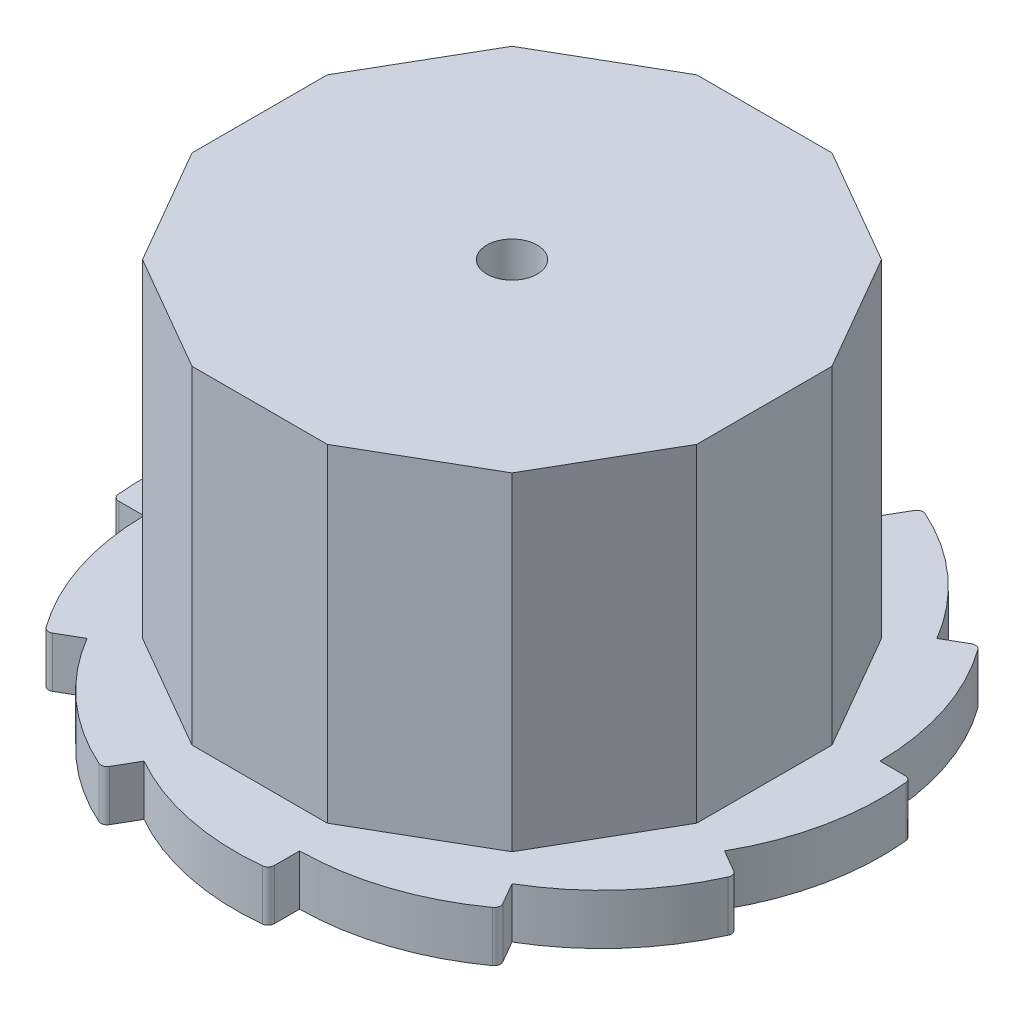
ISO-10303-21;
HEADER;
FILE_DESCRIPTION(('STEP AP214'),'2;1');
FILE_NAME('part.step','',(''),(''),'','','');
FILE_SCHEMA(('AUTOMOTIVE_DESIGN { 1 0 10303 214 1 1 1 1 }'));
ENDSEC;
DATA;
#1=APPLICATION_CONTEXT('core data for automotive mechanical design processes');
#2=APPLICATION_PROTOCOL_DEFINITION('international standard','automotive_design',2000,#1);
#3=PRODUCT_CONTEXT('',#1,'mechanical');
#4=PRODUCT('Part','Part','',(#3));
#5=PRODUCT_RELATED_PRODUCT_CATEGORY('part','',(#4));
#6=PRODUCT_DEFINITION_FORMATION('','',#4);
#7=PRODUCT_DEFINITION_CONTEXT('part definition',#1,'design');
#8=PRODUCT_DEFINITION('design','',#6,#7);
#9=PRODUCT_DEFINITION_SHAPE('','',#8);
#10=(LENGTH_UNIT() NAMED_UNIT(*) SI_UNIT(.MILLI.,.METRE.));
#11=(NAMED_UNIT(*) PLANE_ANGLE_UNIT() SI_UNIT($,.RADIAN.));
#12=(NAMED_UNIT(*) SI_UNIT($,.STERADIAN.) SOLID_ANGLE_UNIT());
#13=UNCERTAINTY_MEASURE_WITH_UNIT(LENGTH_MEASURE(1.E-05),#10,'distance_accuracy_value','');
#14=(GEOMETRIC_REPRESENTATION_CONTEXT(3) GLOBAL_UNCERTAINTY_ASSIGNED_CONTEXT((#13)) GLOBAL_UNIT_ASSIGNED_CONTEXT((#10,
#11,#12)) REPRESENTATION_CONTEXT('',''));
#15=CARTESIAN_POINT('',(0.,0.,0.));
#16=DIRECTION('',(0.,0.,1.));
#17=DIRECTION('',(1.,0.,0.));
#18=AXIS2_PLACEMENT_3D('',#15,#16,#17);
#19=CARTESIAN_POINT('',(-5.35898384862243,-30.5,-17.5));
#20=DIRECTION('',(0.,0.,1.));
#21=DIRECTION('',(1.,0.,0.));
#22=AXIS2_PLACEMENT_3D('',#19,#20,#21);
#23=PLANE('',#22);
#24=DIRECTION('',(1.,0.,0.));
#25=VECTOR('',#24,1.);
#26=CARTESIAN_POINT('',(0.,-26.5,-17.5));
#27=LINE('',#26,#25);
#28=CARTESIAN_POINT('',(-5.35898384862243,-26.5,-17.5));
#29=VERTEX_POINT('',#28);
#30=CARTESIAN_POINT('',(5.35898384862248,-26.5,-17.5));
#31=VERTEX_POINT('',#30);
#32=EDGE_CURVE('E617',#29,#31,#27,.T.);
#33=ORIENTED_EDGE('',*,*,#32,.F.);
#34=DIRECTION('',(0.,1.,0.));
#35=VECTOR('',#34,1.);
#36=CARTESIAN_POINT('',(-5.35898384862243,-30.5,-17.5));
#37=LINE('',#36,#35);
#38=CARTESIAN_POINT('',(-5.35898384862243,-0.5,-17.5));
#39=VERTEX_POINT('',#38);
#40=EDGE_CURVE('E430',#29,#39,#37,.T.);
#41=ORIENTED_EDGE('',*,*,#40,.T.);
#42=DIRECTION('',(1.,0.,0.));
#43=VECTOR('',#42,1.);
#44=CARTESIAN_POINT('',(-5.35898384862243,-0.5,-17.5));
#45=LINE('',#44,#43);
#46=CARTESIAN_POINT('',(5.35898384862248,-0.5,-17.5));
#47=VERTEX_POINT('',#46);
#48=EDGE_CURVE('E393',#39,#47,#45,.T.);
#49=ORIENTED_EDGE('',*,*,#48,.T.);
#50=DIRECTION('',(0.,1.,0.));
#51=VECTOR('',#50,1.);
#52=CARTESIAN_POINT('',(5.35898384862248,-30.5,-17.5));
#53=LINE('',#52,#51);
#54=EDGE_CURVE('E12',#31,#47,#53,.T.);
#55=ORIENTED_EDGE('',*,*,#54,.F.);
#56=EDGE_LOOP('',(#33,#41,#49,#55));
#57=FACE_BOUND('',#56,.T.);
#58=ADVANCED_FACE('F39',(#57),#23,.F.);
#59=CARTESIAN_POINT('',(5.35898384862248,-30.5,-17.5));
#60=DIRECTION('',(-0.5,0.,0.866025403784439));
#61=DIRECTION('',(0.866025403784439,0.,0.5));
#62=AXIS2_PLACEMENT_3D('',#59,#60,#61);
#63=PLANE('',#62);
#64=DIRECTION('',(0.866025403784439,0.,0.5));
#65=VECTOR('',#64,1.);
#66=CARTESIAN_POINT('',(8.91746824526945,-26.5,-15.4455080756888));
#67=LINE('',#66,#65);
#68=CARTESIAN_POINT('',(14.6410161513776,-26.5,-12.1410161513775));
#69=VERTEX_POINT('',#68);
#70=EDGE_CURVE('E53',#31,#69,#67,.T.);
#71=ORIENTED_EDGE('',*,*,#70,.F.);
#72=ORIENTED_EDGE('',*,*,#54,.T.);
#73=DIRECTION('',(0.866025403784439,0.,0.5));
#74=VECTOR('',#73,1.);
#75=CARTESIAN_POINT('',(5.35898384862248,-0.5,-17.5));
#76=LINE('',#75,#74);
#77=CARTESIAN_POINT('',(14.6410161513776,-0.5,-12.1410161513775));
#78=VERTEX_POINT('',#77);
#79=EDGE_CURVE('E396',#47,#78,#76,.T.);
#80=ORIENTED_EDGE('',*,*,#79,.T.);
#81=DIRECTION('',(0.,1.,0.));
#82=VECTOR('',#81,1.);
#83=CARTESIAN_POINT('',(14.6410161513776,-30.5,-12.1410161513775));
#84=LINE('',#83,#82);
#85=EDGE_CURVE('E47',#69,#78,#84,.T.);
#86=ORIENTED_EDGE('',*,*,#85,.F.);
#87=EDGE_LOOP('',(#71,#72,#80,#86));
#88=FACE_BOUND('',#87,.T.);
#89=ADVANCED_FACE('F454',(#88),#63,.F.);
#90=CARTESIAN_POINT('',(14.6410161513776,-30.5,-12.1410161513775));
#91=DIRECTION('',(-0.866025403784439,0.,0.5));
#92=DIRECTION('',(0.5,0.,0.866025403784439));
#93=AXIS2_PLACEMENT_3D('',#90,#91,#92);
#94=PLANE('',#93);
#95=DIRECTION('',(0.5,0.,0.866025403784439));
#96=VECTOR('',#95,1.);
#97=CARTESIAN_POINT('',(16.2379763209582,-26.5,-9.37500000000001));
#98=LINE('',#97,#96);
#99=CARTESIAN_POINT('',(20.,-26.5,-2.85898384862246));
#100=VERTEX_POINT('',#99);
#101=EDGE_CURVE('E61',#69,#100,#98,.T.);
#102=ORIENTED_EDGE('',*,*,#101,.F.);
#103=ORIENTED_EDGE('',*,*,#85,.T.);
#104=DIRECTION('',(0.5,0.,0.866025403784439));
#105=VECTOR('',#104,1.);
#106=CARTESIAN_POINT('',(14.6410161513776,-0.5,-12.1410161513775));
#107=LINE('',#106,#105);
#108=CARTESIAN_POINT('',(20.,-0.5,-2.85898384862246));
#109=VERTEX_POINT('',#108);
#110=EDGE_CURVE('E400',#78,#109,#107,.T.);
#111=ORIENTED_EDGE('',*,*,#110,.T.);
#112=DIRECTION('',(0.,1.,0.));
#113=VECTOR('',#112,1.);
#114=CARTESIAN_POINT('',(20.,-30.5,-2.85898384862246));
#115=LINE('',#114,#113);
#116=EDGE_CURVE('E448',#100,#109,#115,.T.);
#117=ORIENTED_EDGE('',*,*,#116,.F.);
#118=EDGE_LOOP('',(#102,#103,#111,#117));
#119=FACE_BOUND('',#118,.T.);
#120=ADVANCED_FACE('F450',(#119),#94,.F.);
#121=CARTESIAN_POINT('',(20.,-30.5,-2.85898384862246));
#122=DIRECTION('',(-1.,0.,0.));
#123=DIRECTION('',(0.,0.,1.));
#124=AXIS2_PLACEMENT_3D('',#121,#122,#123);
#125=PLANE('',#124);
#126=DIRECTION('',(0.,0.,1.));
#127=VECTOR('',#126,1.);
#128=CARTESIAN_POINT('',(20.,-26.5,0.));
#129=LINE('',#128,#127);
#130=CARTESIAN_POINT('',(20.,-26.5,7.85898384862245));
#131=VERTEX_POINT('',#130);
#132=EDGE_CURVE('E464',#100,#131,#129,.T.);
#133=ORIENTED_EDGE('',*,*,#132,.F.);
#134=ORIENTED_EDGE('',*,*,#116,.T.);
#135=DIRECTION('',(0.,0.,1.));
#136=VECTOR('',#135,1.);
#137=CARTESIAN_POINT('',(20.,-0.5,-2.85898384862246));
#138=LINE('',#137,#136);
#139=CARTESIAN_POINT('',(20.,-0.5,7.85898384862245));
#140=VERTEX_POINT('',#139);
#141=EDGE_CURVE('E403',#109,#140,#138,.T.);
#142=ORIENTED_EDGE('',*,*,#141,.T.);
#143=DIRECTION('',(0.,1.,0.));
#144=VECTOR('',#143,1.);
#145=CARTESIAN_POINT('',(20.,-30.5,7.85898384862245));
#146=LINE('',#145,#144);
#147=EDGE_CURVE('E446',#131,#140,#146,.T.);
#148=ORIENTED_EDGE('',*,*,#147,.F.);
#149=EDGE_LOOP('',(#133,#134,#142,#148));
#150=FACE_BOUND('',#149,.T.);
#151=ADVANCED_FACE('F462',(#150),#125,.F.);
#152=CARTESIAN_POINT('',(20.,-30.5,7.85898384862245));
#153=DIRECTION('',(-0.866025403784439,0.,-0.5));
#154=DIRECTION('',(-0.5,0.,0.866025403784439));
#155=AXIS2_PLACEMENT_3D('',#152,#153,#154);
#156=PLANE('',#155);
#157=DIRECTION('',(-0.5,0.,0.866025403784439));
#158=VECTOR('',#157,1.);
#159=CARTESIAN_POINT('',(18.4030398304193,-26.5,10.625));
#160=LINE('',#159,#158);
#161=CARTESIAN_POINT('',(14.6410161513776,-26.5,17.1410161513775));
#162=VERTEX_POINT('',#161);
#163=EDGE_CURVE('E472',#131,#162,#160,.T.);
#164=ORIENTED_EDGE('',*,*,#163,.F.);
#165=ORIENTED_EDGE('',*,*,#147,.T.);
#166=DIRECTION('',(-0.5,0.,0.866025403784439));
#167=VECTOR('',#166,1.);
#168=CARTESIAN_POINT('',(20.,-0.5,7.85898384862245));
#169=LINE('',#168,#167);
#170=CARTESIAN_POINT('',(14.6410161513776,-0.5,17.1410161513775));
#171=VERTEX_POINT('',#170);
#172=EDGE_CURVE('E406',#140,#171,#169,.T.);
#173=ORIENTED_EDGE('',*,*,#172,.T.);
#174=DIRECTION('',(0.,1.,0.));
#175=VECTOR('',#174,1.);
#176=CARTESIAN_POINT('',(14.6410161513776,-30.5,17.1410161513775));
#177=LINE('',#176,#175);
#178=EDGE_CURVE('E444',#162,#171,#177,.T.);
#179=ORIENTED_EDGE('',*,*,#178,.F.);
#180=EDGE_LOOP('',(#164,#165,#173,#179));
#181=FACE_BOUND('',#180,.T.);
#182=ADVANCED_FACE('F642',(#181),#156,.F.);
#183=CARTESIAN_POINT('',(14.6410161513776,-30.5,17.1410161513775));
#184=DIRECTION('',(-0.5,0.,-0.866025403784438));
#185=DIRECTION('',(-0.866025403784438,0.,0.5));
#186=AXIS2_PLACEMENT_3D('',#183,#184,#185);
#187=PLANE('',#186);
#188=DIRECTION('',(-0.866025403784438,0.,0.5));
#189=VECTOR('',#188,1.);
#190=CARTESIAN_POINT('',(11.0825317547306,-26.5,19.1955080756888));
#191=LINE('',#190,#189);
#192=CARTESIAN_POINT('',(5.35898384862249,-26.5,22.5));
#193=VERTEX_POINT('',#192);
#194=EDGE_CURVE('E638',#162,#193,#191,.T.);
#195=ORIENTED_EDGE('',*,*,#194,.F.);
#196=ORIENTED_EDGE('',*,*,#178,.T.);
#197=DIRECTION('',(-0.866025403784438,0.,0.5));
#198=VECTOR('',#197,1.);
#199=CARTESIAN_POINT('',(14.6410161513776,-0.5,17.1410161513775));
#200=LINE('',#199,#198);
#201=CARTESIAN_POINT('',(5.35898384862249,-0.5,22.5));
#202=VERTEX_POINT('',#201);
#203=EDGE_CURVE('E409',#171,#202,#200,.T.);
#204=ORIENTED_EDGE('',*,*,#203,.T.);
#205=DIRECTION('',(0.,1.,0.));
#206=VECTOR('',#205,1.);
#207=CARTESIAN_POINT('',(5.35898384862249,-30.5,22.5));
#208=LINE('',#207,#206);
#209=EDGE_CURVE('E442',#193,#202,#208,.T.);
#210=ORIENTED_EDGE('',*,*,#209,.F.);
#211=EDGE_LOOP('',(#195,#196,#204,#210));
#212=FACE_BOUND('',#211,.T.);
#213=ADVANCED_FACE('F644',(#212),#187,.F.);
#214=CARTESIAN_POINT('',(5.35898384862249,-30.5,22.5));
#215=DIRECTION('',(0.,0.,-1.));
#216=DIRECTION('',(-1.,0.,0.));
#217=AXIS2_PLACEMENT_3D('',#214,#215,#216);
#218=PLANE('',#217);
#219=DIRECTION('',(-1.,0.,0.));
#220=VECTOR('',#219,1.);
#221=CARTESIAN_POINT('',(0.,-26.5,22.5));
#222=LINE('',#221,#220);
#223=CARTESIAN_POINT('',(-5.35898384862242,-26.5,22.5));
#224=VERTEX_POINT('',#223);
#225=EDGE_CURVE('E635',#193,#224,#222,.T.);
#226=ORIENTED_EDGE('',*,*,#225,.F.);
#227=ORIENTED_EDGE('',*,*,#209,.T.);
#228=DIRECTION('',(-1.,0.,0.));
#229=VECTOR('',#228,1.);
#230=CARTESIAN_POINT('',(5.35898384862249,-0.5,22.5));
#231=LINE('',#230,#229);
#232=CARTESIAN_POINT('',(-5.35898384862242,-0.5,22.5));
#233=VERTEX_POINT('',#232);
#234=EDGE_CURVE('E412',#202,#233,#231,.T.);
#235=ORIENTED_EDGE('',*,*,#234,.T.);
#236=DIRECTION('',(0.,1.,0.));
#237=VECTOR('',#236,1.);
#238=CARTESIAN_POINT('',(-5.35898384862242,-30.5,22.5));
#239=LINE('',#238,#237);
#240=EDGE_CURVE('E440',#224,#233,#239,.T.);
#241=ORIENTED_EDGE('',*,*,#240,.F.);
#242=EDGE_LOOP('',(#226,#227,#235,#241));
#243=FACE_BOUND('',#242,.T.);
#244=ADVANCED_FACE('F648',(#243),#218,.F.);
#245=CARTESIAN_POINT('',(-5.35898384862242,-30.5,22.5));
#246=DIRECTION('',(0.5,0.,-0.866025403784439));
#247=DIRECTION('',(-0.866025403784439,0.,-0.5));
#248=AXIS2_PLACEMENT_3D('',#245,#246,#247);
#249=PLANE('',#248);
#250=DIRECTION('',(-0.866025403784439,0.,-0.5));
#251=VECTOR('',#250,1.);
#252=CARTESIAN_POINT('',(-11.0825317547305,-26.5,19.1955080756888));
#253=LINE('',#252,#251);
#254=CARTESIAN_POINT('',(-14.6410161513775,-26.5,17.1410161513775));
#255=VERTEX_POINT('',#254);
#256=EDGE_CURVE('E632',#224,#255,#253,.T.);
#257=ORIENTED_EDGE('',*,*,#256,.F.);
#258=ORIENTED_EDGE('',*,*,#240,.T.);
#259=DIRECTION('',(-0.866025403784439,0.,-0.5));
#260=VECTOR('',#259,1.);
#261=CARTESIAN_POINT('',(-5.35898384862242,-0.5,22.5));
#262=LINE('',#261,#260);
#263=CARTESIAN_POINT('',(-14.6410161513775,-0.5,17.1410161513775));
#264=VERTEX_POINT('',#263);
#265=EDGE_CURVE('E415',#233,#264,#262,.T.);
#266=ORIENTED_EDGE('',*,*,#265,.T.);
#267=DIRECTION('',(0.,1.,0.));
#268=VECTOR('',#267,1.);
#269=CARTESIAN_POINT('',(-14.6410161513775,-30.5,17.1410161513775));
#270=LINE('',#269,#268);
#271=EDGE_CURVE('E438',#255,#264,#270,.T.);
#272=ORIENTED_EDGE('',*,*,#271,.F.);
#273=EDGE_LOOP('',(#257,#258,#266,#272));
#274=FACE_BOUND('',#273,.T.);
#275=ADVANCED_FACE('F653',(#274),#249,.F.);
#276=CARTESIAN_POINT('',(-14.6410161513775,-30.5,17.1410161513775));
#277=DIRECTION('',(0.866025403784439,0.,-0.5));
#278=DIRECTION('',(-0.5,0.,-0.866025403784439));
#279=AXIS2_PLACEMENT_3D('',#276,#277,#278);
#280=PLANE('',#279);
#281=DIRECTION('',(-0.5,0.,-0.866025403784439));
#282=VECTOR('',#281,1.);
#283=CARTESIAN_POINT('',(-18.4030398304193,-26.5,10.625));
#284=LINE('',#283,#282);
#285=CARTESIAN_POINT('',(-20.,-26.5,7.85898384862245));
#286=VERTEX_POINT('',#285);
#287=EDGE_CURVE('E629',#255,#286,#284,.T.);
#288=ORIENTED_EDGE('',*,*,#287,.F.);
#289=ORIENTED_EDGE('',*,*,#271,.T.);
#290=DIRECTION('',(-0.5,0.,-0.866025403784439));
#291=VECTOR('',#290,1.);
#292=CARTESIAN_POINT('',(-14.6410161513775,-0.5,17.1410161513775));
#293=LINE('',#292,#291);
#294=CARTESIAN_POINT('',(-20.,-0.5,7.85898384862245));
#295=VERTEX_POINT('',#294);
#296=EDGE_CURVE('E418',#264,#295,#293,.T.);
#297=ORIENTED_EDGE('',*,*,#296,.T.);
#298=DIRECTION('',(0.,1.,0.));
#299=VECTOR('',#298,1.);
#300=CARTESIAN_POINT('',(-20.,-30.5,7.85898384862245));
#301=LINE('',#300,#299);
#302=EDGE_CURVE('E436',#286,#295,#301,.T.);
#303=ORIENTED_EDGE('',*,*,#302,.F.);
#304=EDGE_LOOP('',(#288,#289,#297,#303));
#305=FACE_BOUND('',#304,.T.);
#306=ADVANCED_FACE('F656',(#305),#280,.F.);
#307=CARTESIAN_POINT('',(-20.,-30.5,7.85898384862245));
#308=DIRECTION('',(1.,0.,0.));
#309=DIRECTION('',(0.,0.,-1.));
#310=AXIS2_PLACEMENT_3D('',#307,#308,#309);
#311=PLANE('',#310);
#312=DIRECTION('',(0.,0.,-1.));
#313=VECTOR('',#312,1.);
#314=CARTESIAN_POINT('',(-20.,-26.5,0.));
#315=LINE('',#314,#313);
#316=CARTESIAN_POINT('',(-20.,-26.5,-2.85898384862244));
#317=VERTEX_POINT('',#316);
#318=EDGE_CURVE('E626',#286,#317,#315,.T.);
#319=ORIENTED_EDGE('',*,*,#318,.F.);
#320=ORIENTED_EDGE('',*,*,#302,.T.);
#321=DIRECTION('',(0.,0.,-1.));
#322=VECTOR('',#321,1.);
#323=CARTESIAN_POINT('',(-20.,-0.5,7.85898384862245));
#324=LINE('',#323,#322);
#325=CARTESIAN_POINT('',(-20.,-0.5,-2.85898384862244));
#326=VERTEX_POINT('',#325);
#327=EDGE_CURVE('E421',#295,#326,#324,.T.);
#328=ORIENTED_EDGE('',*,*,#327,.T.);
#329=DIRECTION('',(0.,1.,0.));
#330=VECTOR('',#329,1.);
#331=CARTESIAN_POINT('',(-20.,-30.5,-2.85898384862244));
#332=LINE('',#331,#330);
#333=EDGE_CURVE('E434',#317,#326,#332,.T.);
#334=ORIENTED_EDGE('',*,*,#333,.F.);
#335=EDGE_LOOP('',(#319,#320,#328,#334));
#336=FACE_BOUND('',#335,.T.);
#337=ADVANCED_FACE('F660',(#336),#311,.F.);
#338=CARTESIAN_POINT('',(-20.,-30.5,-2.85898384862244));
#339=DIRECTION('',(0.866025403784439,0.,0.5));
#340=DIRECTION('',(0.5,0.,-0.866025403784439));
#341=AXIS2_PLACEMENT_3D('',#338,#339,#340);
#342=PLANE('',#341);
#343=DIRECTION('',(0.5,0.,-0.866025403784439));
#344=VECTOR('',#343,1.);
#345=CARTESIAN_POINT('',(-16.2379763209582,-26.5,-9.37499999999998));
#346=LINE('',#345,#344);
#347=CARTESIAN_POINT('',(-14.6410161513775,-26.5,-12.1410161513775));
#348=VERTEX_POINT('',#347);
#349=EDGE_CURVE('E623',#317,#348,#346,.T.);
#350=ORIENTED_EDGE('',*,*,#349,.F.);
#351=ORIENTED_EDGE('',*,*,#333,.T.);
#352=DIRECTION('',(0.5,0.,-0.866025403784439));
#353=VECTOR('',#352,1.);
#354=CARTESIAN_POINT('',(-20.,-0.5,-2.85898384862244));
#355=LINE('',#354,#353);
#356=CARTESIAN_POINT('',(-14.6410161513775,-0.5,-12.1410161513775));
#357=VERTEX_POINT('',#356);
#358=EDGE_CURVE('E424',#326,#357,#355,.T.);
#359=ORIENTED_EDGE('',*,*,#358,.T.);
#360=DIRECTION('',(0.,1.,0.));
#361=VECTOR('',#360,1.);
#362=CARTESIAN_POINT('',(-14.6410161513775,-30.5,-12.1410161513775));
#363=LINE('',#362,#361);
#364=EDGE_CURVE('E432',#348,#357,#363,.T.);
#365=ORIENTED_EDGE('',*,*,#364,.F.);
#366=EDGE_LOOP('',(#350,#351,#359,#365));
#367=FACE_BOUND('',#366,.T.);
#368=ADVANCED_FACE('F665',(#367),#342,.F.);
#369=CARTESIAN_POINT('',(-14.6410161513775,-30.5,-12.1410161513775));
#370=DIRECTION('',(0.5,0.,0.866025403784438));
#371=DIRECTION('',(0.866025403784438,0.,-0.5));
#372=AXIS2_PLACEMENT_3D('',#369,#370,#371);
#373=PLANE('',#372);
#374=DIRECTION('',(0.866025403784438,0.,-0.5));
#375=VECTOR('',#374,1.);
#376=CARTESIAN_POINT('',(-8.91746824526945,-26.5,-15.4455080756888));
#377=LINE('',#376,#375);
#378=EDGE_CURVE('E620',#348,#29,#377,.T.);
#379=ORIENTED_EDGE('',*,*,#378,.F.);
#380=ORIENTED_EDGE('',*,*,#364,.T.);
#381=DIRECTION('',(0.866025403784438,0.,-0.5));
#382=VECTOR('',#381,1.);
#383=CARTESIAN_POINT('',(-14.6410161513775,-0.5,-12.1410161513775));
#384=LINE('',#383,#382);
#385=EDGE_CURVE('E427',#357,#39,#384,.T.);
#386=ORIENTED_EDGE('',*,*,#385,.T.);
#387=ORIENTED_EDGE('',*,*,#40,.F.);
#388=EDGE_LOOP('',(#379,#380,#386,#387));
#389=FACE_BOUND('',#388,.T.);
#390=ADVANCED_FACE('F668',(#389),#373,.F.);
#391=CARTESIAN_POINT('',(0.,-0.5,0.));
#392=DIRECTION('',(0.,-1.,0.));
#393=DIRECTION('',(0.,0.,-1.));
#394=AXIS2_PLACEMENT_3D('',#391,#392,#393);
#395=PLANE('',#394);
#396=CARTESIAN_POINT('',(0.,-0.5,2.5));
#397=DIRECTION('',(0.,-1.,0.));
#398=DIRECTION('',(0.,0.,-1.));
#399=AXIS2_PLACEMENT_3D('',#396,#397,#398);
#400=CIRCLE('',#399,2.);
#401=CARTESIAN_POINT('',(0.,-0.5,0.500000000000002));
#402=VERTEX_POINT('',#401);
#403=EDGE_CURVE('E852',#402,#402,#400,.F.);
#404=ORIENTED_EDGE('',*,*,#403,.F.);
#405=EDGE_LOOP('',(#404));
#406=FACE_BOUND('',#405,.T.);
#407=ORIENTED_EDGE('',*,*,#48,.F.);
#408=ORIENTED_EDGE('',*,*,#385,.F.);
#409=ORIENTED_EDGE('',*,*,#358,.F.);
#410=ORIENTED_EDGE('',*,*,#327,.F.);
#411=ORIENTED_EDGE('',*,*,#296,.F.);
#412=ORIENTED_EDGE('',*,*,#265,.F.);
#413=ORIENTED_EDGE('',*,*,#234,.F.);
#414=ORIENTED_EDGE('',*,*,#203,.F.);
#415=ORIENTED_EDGE('',*,*,#172,.F.);
#416=ORIENTED_EDGE('',*,*,#141,.F.);
#417=ORIENTED_EDGE('',*,*,#110,.F.);
#418=ORIENTED_EDGE('',*,*,#79,.F.);
#419=EDGE_LOOP('',(#407,#408,#409,#410,#411,#412,#413,#414,#415,#416,#417,#418));
#420=FACE_BOUND('',#419,.T.);
#421=ADVANCED_FACE('F457',(#406,#420),#395,.F.);
#422=CARTESIAN_POINT('',(0.,-26.5,0.));
#423=DIRECTION('',(0.,-1.,0.));
#424=DIRECTION('',(0.,0.,-1.));
#425=AXIS2_PLACEMENT_3D('',#422,#423,#424);
#426=PLANE('',#425);
#427=ORIENTED_EDGE('',*,*,#32,.T.);
#428=ORIENTED_EDGE('',*,*,#70,.T.);
#429=ORIENTED_EDGE('',*,*,#101,.T.);
#430=ORIENTED_EDGE('',*,*,#132,.T.);
#431=ORIENTED_EDGE('',*,*,#163,.T.);
#432=ORIENTED_EDGE('',*,*,#194,.T.);
#433=ORIENTED_EDGE('',*,*,#225,.T.);
#434=ORIENTED_EDGE('',*,*,#256,.T.);
#435=ORIENTED_EDGE('',*,*,#287,.T.);
#436=ORIENTED_EDGE('',*,*,#318,.T.);
#437=ORIENTED_EDGE('',*,*,#349,.T.);
#438=ORIENTED_EDGE('',*,*,#378,.T.);
#439=EDGE_LOOP('',(#427,#428,#429,#430,#431,#432,#433,#434,#435,#436,#437,#438));
#440=FACE_BOUND('',#439,.T.);
#441=DIRECTION('',(0.86602540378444,0.,-0.499999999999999));
#442=VECTOR('',#441,1.);
#443=CARTESIAN_POINT('',(-1.99888395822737,-26.5,-3.4621685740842));
#444=LINE('',#443,#442);
#445=CARTESIAN_POINT('',(16.8371685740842,-26.5,-14.3371685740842));
#446=VERTEX_POINT('',#445);
#447=CARTESIAN_POINT('',(18.5692193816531,-26.5,-15.3371685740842));
#448=VERTEX_POINT('',#447);
#449=EDGE_CURVE('E570',#446,#448,#444,.T.);
#450=ORIENTED_EDGE('',*,*,#449,.F.);
#451=CARTESIAN_POINT('',(-0.402058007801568,-26.5,-4.19768797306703));
#452=DIRECTION('',(0.,-1.,0.));
#453=DIRECTION('',(0.,0.,-1.));
#454=AXIS2_PLACEMENT_3D('',#451,#452,#453);
#455=CIRCLE('',#454,20.);
#456=CARTESIAN_POINT('',(7.80091854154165,-26.5,-22.4380601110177));
#457=VERTEX_POINT('',#456);
#458=EDGE_CURVE('E871',#457,#446,#455,.T.);
#459=ORIENTED_EDGE('',*,*,#458,.F.);
#460=CARTESIAN_POINT('',(7.59584412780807,-26.5,-21.9820508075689));
#461=DIRECTION('',(0.,-1.,0.));
#462=DIRECTION('',(0.,0.,-1.));
#463=AXIS2_PLACEMENT_3D('',#460,#461,#462);
#464=CIRCLE('',#463,0.500000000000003);
#465=CARTESIAN_POINT('',(7.16283142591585,-26.5,-22.2320508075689));
#466=VERTEX_POINT('',#465);
#467=EDGE_CURVE('E875',#466,#457,#464,.T.);
#468=ORIENTED_EDGE('',*,*,#467,.F.);
#469=DIRECTION('',(0.499999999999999,0.,-0.866025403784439));
#470=VECTOR('',#469,1.);
#471=CARTESIAN_POINT('',(-4.2546368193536,-26.5,-2.45641571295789));
#472=LINE('',#471,#470);
#473=CARTESIAN_POINT('',(6.16283142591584,-26.5,-20.5));
#474=VERTEX_POINT('',#473);
#475=EDGE_CURVE('E366',#474,#466,#472,.T.);
#476=ORIENTED_EDGE('',*,*,#475,.F.);
#477=CARTESIAN_POINT('',(-3.69703643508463,-26.5,-3.09933892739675));
#478=DIRECTION('',(0.,-1.,0.));
#479=DIRECTION('',(0.,0.,-1.));
#480=AXIS2_PLACEMENT_3D('',#477,#478,#479);
#481=CIRCLE('',#480,20.);
#482=CARTESIAN_POINT('',(-5.71323642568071,-26.5,-22.9974528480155));
#483=VERTEX_POINT('',#482);
#484=EDGE_CURVE('E897',#483,#474,#481,.T.);
#485=ORIENTED_EDGE('',*,*,#484,.F.);
#486=CARTESIAN_POINT('',(-5.6628314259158,-26.5,-22.5));
#487=DIRECTION('',(0.,-1.,0.));
#488=DIRECTION('',(0.,0.,-1.));
#489=AXIS2_PLACEMENT_3D('',#486,#487,#488);
#490=CIRCLE('',#489,0.500000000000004);
#491=CARTESIAN_POINT('',(-6.1628314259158,-26.5,-22.5));
#492=VERTEX_POINT('',#491);
#493=EDGE_CURVE('E893',#492,#483,#490,.T.);
#494=ORIENTED_EDGE('',*,*,#493,.F.);
#495=DIRECTION('',(0.,0.,-1.));
#496=VECTOR('',#495,1.);
#497=CARTESIAN_POINT('',(-6.1628314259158,-26.5,0.));
#498=LINE('',#497,#496);
#499=CARTESIAN_POINT('',(-6.1628314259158,-26.5,-20.5));
#500=VERTEX_POINT('',#499);
#501=EDGE_CURVE('E879',#500,#492,#498,.T.);
#502=ORIENTED_EDGE('',*,*,#501,.F.);
#503=CARTESIAN_POINT('',(-6.00139693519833,-26.5,-0.500651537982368));
#504=DIRECTION('',(0.,-1.,0.));
#505=DIRECTION('',(0.,0.,-1.));
#506=AXIS2_PLACEMENT_3D('',#503,#504,#505);
#507=CIRCLE('',#506,20.);
#508=CARTESIAN_POINT('',(-17.6965343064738,-26.5,-16.7248236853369));
#509=VERTEX_POINT('',#508);
#510=EDGE_CURVE('E919',#509,#500,#507,.T.);
#511=ORIENTED_EDGE('',*,*,#510,.F.);
#512=CARTESIAN_POINT('',(-17.4041558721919,-26.5,-16.3192193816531));
#513=DIRECTION('',(0.,-1.,0.));
#514=DIRECTION('',(0.,0.,-1.));
#515=AXIS2_PLACEMENT_3D('',#512,#513,#514);
#516=CIRCLE('',#515,0.500000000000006);
#517=CARTESIAN_POINT('',(-17.8371685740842,-26.5,-16.0692193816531));
#518=VERTEX_POINT('',#517);
#519=EDGE_CURVE('E915',#518,#509,#516,.T.);
#520=ORIENTED_EDGE('',*,*,#519,.F.);
#521=DIRECTION('',(-0.499999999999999,0.,-0.86602540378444));
#522=VECTOR('',#521,1.);
#523=CARTESIAN_POINT('',(-6.41970032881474,-26.5,3.70641571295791));
#524=LINE('',#523,#522);
#525=CARTESIAN_POINT('',(-16.8371685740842,-26.5,-14.3371685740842));
#526=VERTEX_POINT('',#525);
#527=EDGE_CURVE('E909',#526,#518,#524,.T.);
#528=ORIENTED_EDGE('',*,*,#527,.F.);
#529=CARTESIAN_POINT('',(-6.697687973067,-26.5,2.9020580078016));
#530=DIRECTION('',(0.,-1.,0.));
#531=DIRECTION('',(0.,0.,-1.));
#532=AXIS2_PLACEMENT_3D('',#529,#530,#531);
#533=CIRCLE('',#532,20.);
#534=CARTESIAN_POINT('',(-24.9380601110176,-26.5,-5.30091854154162));
#535=VERTEX_POINT('',#534);
#536=EDGE_CURVE('E941',#535,#526,#533,.T.);
#537=ORIENTED_EDGE('',*,*,#536,.F.);
#538=CARTESIAN_POINT('',(-24.4820508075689,-26.5,-5.09584412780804));
#539=DIRECTION('',(0.,-1.,0.));
#540=DIRECTION('',(0.,0.,-1.));
#541=AXIS2_PLACEMENT_3D('',#538,#539,#540);
#542=CIRCLE('',#541,0.500000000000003);
#543=CARTESIAN_POINT('',(-24.7320508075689,-26.5,-4.66283142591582));
#544=VERTEX_POINT('',#543);
#545=EDGE_CURVE('E937',#544,#535,#542,.T.);
#546=ORIENTED_EDGE('',*,*,#545,.F.);
#547=DIRECTION('',(-0.866025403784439,0.,-0.499999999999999));
#548=VECTOR('',#547,1.);
#549=CARTESIAN_POINT('',(-4.16394746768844,-26.5,7.21216857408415));
#550=LINE('',#549,#548);
#551=CARTESIAN_POINT('',(-23.,-26.5,-3.66283142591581));
#552=VERTEX_POINT('',#551);
#553=EDGE_CURVE('E931',#552,#544,#550,.T.);
#554=ORIENTED_EDGE('',*,*,#553,.F.);
#555=CARTESIAN_POINT('',(-5.59933892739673,-26.5,6.19703643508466));
#556=DIRECTION('',(0.,-1.,0.));
#557=DIRECTION('',(0.,0.,-1.));
#558=AXIS2_PLACEMENT_3D('',#555,#556,#557);
#559=CIRCLE('',#558,20.);
#560=CARTESIAN_POINT('',(-25.4974528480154,-26.5,8.21323642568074));
#561=VERTEX_POINT('',#560);
#562=EDGE_CURVE('E962',#561,#552,#559,.T.);
#563=ORIENTED_EDGE('',*,*,#562,.F.);
#564=CARTESIAN_POINT('',(-25.,-26.5,8.16283142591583));
#565=DIRECTION('',(0.,-1.,0.));
#566=DIRECTION('',(0.,0.,-1.));
#567=AXIS2_PLACEMENT_3D('',#564,#565,#566);
#568=CIRCLE('',#567,0.500000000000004);
#569=CARTESIAN_POINT('',(-25.,-26.5,8.66283142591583));
#570=VERTEX_POINT('',#569);
#571=EDGE_CURVE('E958',#570,#561,#568,.T.);
#572=ORIENTED_EDGE('',*,*,#571,.F.);
#573=DIRECTION('',(-1.,0.,0.));
#574=VECTOR('',#573,1.);
#575=CARTESIAN_POINT('',(0.,-26.5,8.66283142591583));
#576=LINE('',#575,#574);
#577=CARTESIAN_POINT('',(-23.,-26.5,8.66283142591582));
#578=VERTEX_POINT('',#577);
#579=EDGE_CURVE('E952',#578,#570,#576,.T.);
#580=ORIENTED_EDGE('',*,*,#579,.F.);
#581=CARTESIAN_POINT('',(-3.00065153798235,-26.5,8.50139693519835));
#582=DIRECTION('',(0.,-1.,0.));
#583=DIRECTION('',(0.,0.,-1.));
#584=AXIS2_PLACEMENT_3D('',#581,#582,#583);
#585=CIRCLE('',#584,20.);
#586=CARTESIAN_POINT('',(-19.2248236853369,-26.5,20.1965343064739));
#587=VERTEX_POINT('',#586);
#588=EDGE_CURVE('E541',#587,#578,#585,.T.);
#589=ORIENTED_EDGE('',*,*,#588,.F.);
#590=CARTESIAN_POINT('',(-18.819219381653,-26.5,19.904155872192));
#591=DIRECTION('',(0.,-1.,0.));
#592=DIRECTION('',(0.,0.,-1.));
#593=AXIS2_PLACEMENT_3D('',#590,#591,#592);
#594=CIRCLE('',#593,0.500000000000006);
#595=CARTESIAN_POINT('',(-18.569219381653,-26.5,20.3371685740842));
#596=VERTEX_POINT('',#595);
#597=EDGE_CURVE('E532',#596,#587,#594,.T.);
#598=ORIENTED_EDGE('',*,*,#597,.F.);
#599=DIRECTION('',(-0.866025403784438,0.,0.500000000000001));
#600=VECTOR('',#599,1.);
#601=CARTESIAN_POINT('',(-16.8371685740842,-26.5,19.3371685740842));
#602=LINE('',#601,#600);
#603=CARTESIAN_POINT('',(-16.8371685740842,-26.5,19.3371685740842));
#604=VERTEX_POINT('',#603);
#605=EDGE_CURVE('E526',#604,#596,#602,.T.);
#606=ORIENTED_EDGE('',*,*,#605,.F.);
#607=CARTESIAN_POINT('',(0.402058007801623,-26.5,9.19768797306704));
#608=DIRECTION('',(0.,-1.,0.));
#609=DIRECTION('',(0.,0.,-1.));
#610=AXIS2_PLACEMENT_3D('',#607,#608,#609);
#611=CIRCLE('',#610,20.);
#612=CARTESIAN_POINT('',(-7.8009185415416,-26.5,27.4380601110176));
#613=VERTEX_POINT('',#612);
#614=EDGE_CURVE('E518',#613,#604,#611,.T.);
#615=ORIENTED_EDGE('',*,*,#614,.F.);
#616=CARTESIAN_POINT('',(-7.59584412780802,-26.5,26.9820508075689));
#617=DIRECTION('',(0.,-1.,0.));
#618=DIRECTION('',(0.,0.,-1.));
#619=AXIS2_PLACEMENT_3D('',#616,#617,#618);
#620=CIRCLE('',#619,0.500000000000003);
#621=CARTESIAN_POINT('',(-7.1628314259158,-26.5,27.2320508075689));
#622=VERTEX_POINT('',#621);
#623=EDGE_CURVE('E514',#622,#613,#620,.T.);
#624=ORIENTED_EDGE('',*,*,#623,.F.);
#625=DIRECTION('',(-0.5,0.,0.866025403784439));
#626=VECTOR('',#625,1.);
#627=CARTESIAN_POINT('',(-6.1628314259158,-26.5,25.5));
#628=LINE('',#627,#626);
#629=CARTESIAN_POINT('',(-6.16283142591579,-26.5,25.5));
#630=VERTEX_POINT('',#629);
#631=EDGE_CURVE('E519',#630,#622,#628,.T.);
#632=ORIENTED_EDGE('',*,*,#631,.F.);
#633=CARTESIAN_POINT('',(3.69703643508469,-26.5,8.09933892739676));
#634=DIRECTION('',(0.,-1.,0.));
#635=DIRECTION('',(0.,0.,-1.));
#636=AXIS2_PLACEMENT_3D('',#633,#634,#635);
#637=CIRCLE('',#636,20.);
#638=CARTESIAN_POINT('',(5.71323642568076,-26.5,27.9974528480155));
#639=VERTEX_POINT('',#638);
#640=EDGE_CURVE('E495',#639,#630,#637,.T.);
#641=ORIENTED_EDGE('',*,*,#640,.F.);
#642=CARTESIAN_POINT('',(5.66283142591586,-26.5,27.5));
#643=DIRECTION('',(0.,-1.,0.));
#644=DIRECTION('',(0.,0.,-1.));
#645=AXIS2_PLACEMENT_3D('',#642,#643,#644);
#646=CIRCLE('',#645,0.500000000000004);
#647=CARTESIAN_POINT('',(6.16283142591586,-26.5,27.5));
#648=VERTEX_POINT('',#647);
#649=EDGE_CURVE('E538',#648,#639,#646,.T.);
#650=ORIENTED_EDGE('',*,*,#649,.F.);
#651=DIRECTION('',(0.,0.,1.));
#652=VECTOR('',#651,1.);
#653=CARTESIAN_POINT('',(6.16283142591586,-26.5,25.5));
#654=LINE('',#653,#652);
#655=CARTESIAN_POINT('',(6.16283142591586,-26.5,25.5));
#656=VERTEX_POINT('',#655);
#657=EDGE_CURVE('E552',#656,#648,#654,.T.);
#658=ORIENTED_EDGE('',*,*,#657,.F.);
#659=CARTESIAN_POINT('',(6.00139693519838,-26.5,5.50065153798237));
#660=DIRECTION('',(0.,-1.,0.));
#661=DIRECTION('',(0.,0.,-1.));
#662=AXIS2_PLACEMENT_3D('',#659,#660,#661);
#663=CIRCLE('',#662,20.);
#664=CARTESIAN_POINT('',(17.6965343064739,-26.5,21.7248236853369));
#665=VERTEX_POINT('',#664);
#666=EDGE_CURVE('E572',#665,#656,#663,.T.);
#667=ORIENTED_EDGE('',*,*,#666,.F.);
#668=CARTESIAN_POINT('',(17.404155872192,-26.5,21.319219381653));
#669=DIRECTION('',(0.,-1.,0.));
#670=DIRECTION('',(0.,0.,-1.));
#671=AXIS2_PLACEMENT_3D('',#668,#669,#670);
#672=CIRCLE('',#671,0.500000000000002);
#673=CARTESIAN_POINT('',(17.8371685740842,-26.5,21.0692193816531));
#674=VERTEX_POINT('',#673);
#675=EDGE_CURVE('E355',#674,#665,#672,.T.);
#676=ORIENTED_EDGE('',*,*,#675,.F.);
#677=DIRECTION('',(0.500000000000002,0.,0.866025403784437));
#678=VECTOR('',#677,1.);
#679=CARTESIAN_POINT('',(16.8371685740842,-26.5,19.3371685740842));
#680=LINE('',#679,#678);
#681=CARTESIAN_POINT('',(16.8371685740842,-26.5,19.3371685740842));
#682=VERTEX_POINT('',#681);
#683=EDGE_CURVE('E564',#682,#674,#680,.T.);
#684=ORIENTED_EDGE('',*,*,#683,.F.);
#685=CARTESIAN_POINT('',(6.69768797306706,-26.5,2.0979419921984));
#686=DIRECTION('',(0.,-1.,0.));
#687=DIRECTION('',(0.,0.,-1.));
#688=AXIS2_PLACEMENT_3D('',#685,#686,#687);
#689=CIRCLE('',#688,20.);
#690=CARTESIAN_POINT('',(24.9380601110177,-26.5,10.3009185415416));
#691=VERTEX_POINT('',#690);
#692=EDGE_CURVE('E371',#691,#682,#689,.T.);
#693=ORIENTED_EDGE('',*,*,#692,.F.);
#694=CARTESIAN_POINT('',(24.4820508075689,-26.5,10.095844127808));
#695=DIRECTION('',(0.,-1.,0.));
#696=DIRECTION('',(0.,0.,-1.));
#697=AXIS2_PLACEMENT_3D('',#694,#695,#696);
#698=CIRCLE('',#697,0.500000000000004);
#699=CARTESIAN_POINT('',(24.7320508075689,-26.5,9.66283142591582));
#700=VERTEX_POINT('',#699);
#701=EDGE_CURVE('E862',#700,#691,#698,.T.);
#702=ORIENTED_EDGE('',*,*,#701,.F.);
#703=DIRECTION('',(0.866025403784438,0.,0.500000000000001));
#704=VECTOR('',#703,1.);
#705=CARTESIAN_POINT('',(1.99888395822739,-26.5,-3.46216857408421));
#706=LINE('',#705,#704);
#707=CARTESIAN_POINT('',(23.,-26.5,8.66283142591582));
#708=VERTEX_POINT('',#707);
#709=EDGE_CURVE('E853',#708,#700,#706,.T.);
#710=ORIENTED_EDGE('',*,*,#709,.F.);
#711=CARTESIAN_POINT('',(5.59933892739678,-26.5,-1.19703643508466));
#712=DIRECTION('',(0.,-1.,0.));
#713=DIRECTION('',(0.,0.,-1.));
#714=AXIS2_PLACEMENT_3D('',#711,#712,#713);
#715=CIRCLE('',#714,20.);
#716=CARTESIAN_POINT('',(25.4974528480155,-26.5,-3.21323642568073));
#717=VERTEX_POINT('',#716);
#718=EDGE_CURVE('E606',#717,#708,#715,.T.);
#719=ORIENTED_EDGE('',*,*,#718,.F.);
#720=CARTESIAN_POINT('',(25.,-26.5,-3.16283142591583));
#721=DIRECTION('',(0.,-1.,0.));
#722=DIRECTION('',(0.,0.,-1.));
#723=AXIS2_PLACEMENT_3D('',#720,#721,#722);
#724=CIRCLE('',#723,0.500000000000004);
#725=CARTESIAN_POINT('',(25.,-26.5,-3.66283142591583));
#726=VERTEX_POINT('',#725);
#727=EDGE_CURVE('E602',#726,#717,#724,.T.);
#728=ORIENTED_EDGE('',*,*,#727,.F.);
#729=DIRECTION('',(1.,0.,0.));
#730=VECTOR('',#729,1.);
#731=CARTESIAN_POINT('',(0.,-26.5,-3.66283142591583));
#732=LINE('',#731,#730);
#733=CARTESIAN_POINT('',(23.,-26.5,-3.66283142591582));
#734=VERTEX_POINT('',#733);
#735=EDGE_CURVE('E599',#734,#726,#732,.T.);
#736=ORIENTED_EDGE('',*,*,#735,.F.);
#737=CARTESIAN_POINT('',(3.0006515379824,-26.5,-3.50139693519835));
#738=DIRECTION('',(0.,-1.,0.));
#739=DIRECTION('',(0.,0.,-1.));
#740=AXIS2_PLACEMENT_3D('',#737,#738,#739);
#741=CIRCLE('',#740,20.);
#742=CARTESIAN_POINT('',(19.224823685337,-26.5,-15.1965343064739));
#743=VERTEX_POINT('',#742);
#744=EDGE_CURVE('E584',#743,#734,#741,.T.);
#745=ORIENTED_EDGE('',*,*,#744,.F.);
#746=CARTESIAN_POINT('',(18.8192193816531,-26.5,-14.904155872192));
#747=DIRECTION('',(0.,-1.,0.));
#748=DIRECTION('',(0.,0.,-1.));
#749=AXIS2_PLACEMENT_3D('',#746,#747,#748);
#750=CIRCLE('',#749,0.500000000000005);
#751=EDGE_CURVE('E580',#448,#743,#750,.T.);
#752=ORIENTED_EDGE('',*,*,#751,.F.);
#753=EDGE_LOOP('',(#450,#459,#468,#476,#485,#494,#502,#511,#520,#528,#537,#546,#554,#563,#572,
#580,#589,#598,#606,#615,#624,#632,#641,#650,#658,#667,#676,#684,#693,#702,#710,#719,#728,#736,
#745,#752));
#754=FACE_BOUND('',#753,.T.);
#755=ADVANCED_FACE('F467',(#440,#754),#426,.F.);
#756=CARTESIAN_POINT('',(0.,-30.5,0.));
#757=DIRECTION('',(0.,-1.,0.));
#758=DIRECTION('',(0.,0.,-1.));
#759=AXIS2_PLACEMENT_3D('',#756,#757,#758);
#760=PLANE('',#759);
#761=CARTESIAN_POINT('',(0.,-30.5,2.5));
#762=DIRECTION('',(0.,-1.,0.));
#763=DIRECTION('',(0.,0.,-1.));
#764=AXIS2_PLACEMENT_3D('',#761,#762,#763);
#765=CIRCLE('',#764,2.);
#766=CARTESIAN_POINT('',(0.,-30.5,0.500000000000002));
#767=VERTEX_POINT('',#766);
#768=EDGE_CURVE('E42',#767,#767,#765,.F.);
#769=ORIENTED_EDGE('',*,*,#768,.T.);
#770=EDGE_LOOP('',(#769));
#771=FACE_BOUND('',#770,.T.);
#772=CARTESIAN_POINT('',(-6.697687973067,-30.5,2.9020580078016));
#773=DIRECTION('',(0.,-1.,0.));
#774=DIRECTION('',(0.,0.,-1.));
#775=AXIS2_PLACEMENT_3D('',#772,#773,#774);
#776=CIRCLE('',#775,20.);
#777=CARTESIAN_POINT('',(-24.9380601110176,-30.5,-5.30091854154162));
#778=VERTEX_POINT('',#777);
#779=CARTESIAN_POINT('',(-16.8371685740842,-30.5,-14.3371685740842));
#780=VERTEX_POINT('',#779);
#781=EDGE_CURVE('E950',#778,#780,#776,.T.);
#782=ORIENTED_EDGE('',*,*,#781,.T.);
#783=DIRECTION('',(-0.499999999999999,0.,-0.86602540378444));
#784=VECTOR('',#783,1.);
#785=CARTESIAN_POINT('',(-6.41970032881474,-30.5,3.70641571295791));
#786=LINE('',#785,#784);
#787=CARTESIAN_POINT('',(-17.8371685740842,-30.5,-16.0692193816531));
#788=VERTEX_POINT('',#787);
#789=EDGE_CURVE('E922',#780,#788,#786,.T.);
#790=ORIENTED_EDGE('',*,*,#789,.T.);
#791=CARTESIAN_POINT('',(-17.4041558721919,-30.5,-16.3192193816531));
#792=DIRECTION('',(0.,-1.,0.));
#793=DIRECTION('',(0.,0.,-1.));
#794=AXIS2_PLACEMENT_3D('',#791,#792,#793);
#795=CIRCLE('',#794,0.500000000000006);
#796=CARTESIAN_POINT('',(-17.6965343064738,-30.5,-16.7248236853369));
#797=VERTEX_POINT('',#796);
#798=EDGE_CURVE('E925',#788,#797,#795,.T.);
#799=ORIENTED_EDGE('',*,*,#798,.T.);
#800=CARTESIAN_POINT('',(-6.00139693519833,-30.5,-0.500651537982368));
#801=DIRECTION('',(0.,-1.,0.));
#802=DIRECTION('',(0.,0.,-1.));
#803=AXIS2_PLACEMENT_3D('',#800,#801,#802);
#804=CIRCLE('',#803,20.);
#805=CARTESIAN_POINT('',(-6.1628314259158,-30.5,-20.5));
#806=VERTEX_POINT('',#805);
#807=EDGE_CURVE('E928',#797,#806,#804,.T.);
#808=ORIENTED_EDGE('',*,*,#807,.T.);
#809=DIRECTION('',(0.,0.,-1.));
#810=VECTOR('',#809,1.);
#811=CARTESIAN_POINT('',(-6.1628314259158,-30.5,0.));
#812=LINE('',#811,#810);
#813=CARTESIAN_POINT('',(-6.1628314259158,-30.5,-22.5));
#814=VERTEX_POINT('',#813);
#815=EDGE_CURVE('E900',#806,#814,#812,.T.);
#816=ORIENTED_EDGE('',*,*,#815,.T.);
#817=CARTESIAN_POINT('',(-5.6628314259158,-30.5,-22.5));
#818=DIRECTION('',(0.,-1.,0.));
#819=DIRECTION('',(0.,0.,-1.));
#820=AXIS2_PLACEMENT_3D('',#817,#818,#819);
#821=CIRCLE('',#820,0.500000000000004);
#822=CARTESIAN_POINT('',(-5.71323642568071,-30.5,-22.9974528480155));
#823=VERTEX_POINT('',#822);
#824=EDGE_CURVE('E903',#814,#823,#821,.T.);
#825=ORIENTED_EDGE('',*,*,#824,.T.);
#826=CARTESIAN_POINT('',(-3.69703643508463,-30.5,-3.09933892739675));
#827=DIRECTION('',(0.,-1.,0.));
#828=DIRECTION('',(0.,0.,-1.));
#829=AXIS2_PLACEMENT_3D('',#826,#827,#828);
#830=CIRCLE('',#829,20.);
#831=CARTESIAN_POINT('',(6.16283142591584,-30.5,-20.5));
#832=VERTEX_POINT('',#831);
#833=EDGE_CURVE('E906',#823,#832,#830,.T.);
#834=ORIENTED_EDGE('',*,*,#833,.T.);
#835=DIRECTION('',(0.499999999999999,0.,-0.866025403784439));
#836=VECTOR('',#835,1.);
#837=CARTESIAN_POINT('',(-4.2546368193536,-30.5,-2.45641571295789));
#838=LINE('',#837,#836);
#839=CARTESIAN_POINT('',(7.16283142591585,-30.5,-22.2320508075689));
#840=VERTEX_POINT('',#839);
#841=EDGE_CURVE('E874',#832,#840,#838,.T.);
#842=ORIENTED_EDGE('',*,*,#841,.T.);
#843=CARTESIAN_POINT('',(7.59584412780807,-30.5,-21.9820508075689));
#844=DIRECTION('',(0.,-1.,0.));
#845=DIRECTION('',(0.,0.,-1.));
#846=AXIS2_PLACEMENT_3D('',#843,#844,#845);
#847=CIRCLE('',#846,0.500000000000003);
#848=CARTESIAN_POINT('',(7.80091854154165,-30.5,-22.4380601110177));
#849=VERTEX_POINT('',#848);
#850=EDGE_CURVE('E880',#840,#849,#847,.T.);
#851=ORIENTED_EDGE('',*,*,#850,.T.);
#852=CARTESIAN_POINT('',(-0.402058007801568,-30.5,-4.19768797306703));
#853=DIRECTION('',(0.,-1.,0.));
#854=DIRECTION('',(0.,0.,-1.));
#855=AXIS2_PLACEMENT_3D('',#852,#853,#854);
#856=CIRCLE('',#855,20.);
#857=CARTESIAN_POINT('',(16.8371685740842,-30.5,-14.3371685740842));
#858=VERTEX_POINT('',#857);
#859=EDGE_CURVE('E876',#849,#858,#856,.T.);
#860=ORIENTED_EDGE('',*,*,#859,.T.);
#861=DIRECTION('',(0.86602540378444,0.,-0.499999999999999));
#862=VECTOR('',#861,1.);
#863=CARTESIAN_POINT('',(-1.99888395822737,-30.5,-3.4621685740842));
#864=LINE('',#863,#862);
#865=CARTESIAN_POINT('',(18.5692193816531,-30.5,-15.3371685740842));
#866=VERTEX_POINT('',#865);
#867=EDGE_CURVE('E587',#858,#866,#864,.T.);
#868=ORIENTED_EDGE('',*,*,#867,.T.);
#869=CARTESIAN_POINT('',(18.8192193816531,-30.5,-14.904155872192));
#870=DIRECTION('',(0.,-1.,0.));
#871=DIRECTION('',(0.,0.,-1.));
#872=AXIS2_PLACEMENT_3D('',#869,#870,#871);
#873=CIRCLE('',#872,0.500000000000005);
#874=CARTESIAN_POINT('',(19.224823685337,-30.5,-15.1965343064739));
#875=VERTEX_POINT('',#874);
#876=EDGE_CURVE('E590',#866,#875,#873,.T.);
#877=ORIENTED_EDGE('',*,*,#876,.T.);
#878=CARTESIAN_POINT('',(3.0006515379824,-30.5,-3.50139693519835));
#879=DIRECTION('',(0.,-1.,0.));
#880=DIRECTION('',(0.,0.,-1.));
#881=AXIS2_PLACEMENT_3D('',#878,#879,#880);
#882=CIRCLE('',#881,20.);
#883=CARTESIAN_POINT('',(23.,-30.5,-3.66283142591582));
#884=VERTEX_POINT('',#883);
#885=EDGE_CURVE('E593',#875,#884,#882,.T.);
#886=ORIENTED_EDGE('',*,*,#885,.T.);
#887=DIRECTION('',(1.,0.,0.));
#888=VECTOR('',#887,1.);
#889=CARTESIAN_POINT('',(0.,-30.5,-3.66283142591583));
#890=LINE('',#889,#888);
#891=CARTESIAN_POINT('',(25.,-30.5,-3.66283142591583));
#892=VERTEX_POINT('',#891);
#893=EDGE_CURVE('E596',#884,#892,#890,.T.);
#894=ORIENTED_EDGE('',*,*,#893,.T.);
#895=CARTESIAN_POINT('',(25.,-30.5,-3.16283142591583));
#896=DIRECTION('',(0.,-1.,0.));
#897=DIRECTION('',(0.,0.,-1.));
#898=AXIS2_PLACEMENT_3D('',#895,#896,#897);
#899=CIRCLE('',#898,0.500000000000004);
#900=CARTESIAN_POINT('',(25.4974528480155,-30.5,-3.21323642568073));
#901=VERTEX_POINT('',#900);
#902=EDGE_CURVE('E611',#892,#901,#899,.T.);
#903=ORIENTED_EDGE('',*,*,#902,.T.);
#904=CARTESIAN_POINT('',(5.59933892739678,-30.5,-1.19703643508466));
#905=DIRECTION('',(0.,-1.,0.));
#906=DIRECTION('',(0.,0.,-1.));
#907=AXIS2_PLACEMENT_3D('',#904,#905,#906);
#908=CIRCLE('',#907,20.);
#909=CARTESIAN_POINT('',(23.,-30.5,8.66283142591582));
#910=VERTEX_POINT('',#909);
#911=EDGE_CURVE('E603',#901,#910,#908,.T.);
#912=ORIENTED_EDGE('',*,*,#911,.T.);
#913=DIRECTION('',(0.866025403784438,0.,0.500000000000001));
#914=VECTOR('',#913,1.);
#915=CARTESIAN_POINT('',(1.99888395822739,-30.5,-3.46216857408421));
#916=LINE('',#915,#914);
#917=CARTESIAN_POINT('',(24.7320508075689,-30.5,9.66283142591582));
#918=VERTEX_POINT('',#917);
#919=EDGE_CURVE('E861',#910,#918,#916,.T.);
#920=ORIENTED_EDGE('',*,*,#919,.T.);
#921=CARTESIAN_POINT('',(24.4820508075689,-30.5,10.095844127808));
#922=DIRECTION('',(0.,-1.,0.));
#923=DIRECTION('',(0.,0.,-1.));
#924=AXIS2_PLACEMENT_3D('',#921,#922,#923);
#925=CIRCLE('',#924,0.500000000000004);
#926=CARTESIAN_POINT('',(24.9380601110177,-30.5,10.3009185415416));
#927=VERTEX_POINT('',#926);
#928=EDGE_CURVE('E364',#918,#927,#925,.T.);
#929=ORIENTED_EDGE('',*,*,#928,.T.);
#930=CARTESIAN_POINT('',(6.69768797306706,-30.5,2.0979419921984));
#931=DIRECTION('',(0.,-1.,0.));
#932=DIRECTION('',(0.,0.,-1.));
#933=AXIS2_PLACEMENT_3D('',#930,#931,#932);
#934=CIRCLE('',#933,20.);
#935=CARTESIAN_POINT('',(16.8371685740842,-30.5,19.3371685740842));
#936=VERTEX_POINT('',#935);
#937=EDGE_CURVE('E359',#927,#936,#934,.T.);
#938=ORIENTED_EDGE('',*,*,#937,.T.);
#939=DIRECTION('',(0.500000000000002,0.,0.866025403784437));
#940=VECTOR('',#939,1.);
#941=CARTESIAN_POINT('',(16.8371685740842,-30.5,19.3371685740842));
#942=LINE('',#941,#940);
#943=CARTESIAN_POINT('',(17.8371685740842,-30.5,21.0692193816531));
#944=VERTEX_POINT('',#943);
#945=EDGE_CURVE('E343',#936,#944,#942,.T.);
#946=ORIENTED_EDGE('',*,*,#945,.T.);
#947=CARTESIAN_POINT('',(17.404155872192,-30.5,21.319219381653));
#948=DIRECTION('',(0.,-1.,0.));
#949=DIRECTION('',(0.,0.,-1.));
#950=AXIS2_PLACEMENT_3D('',#947,#948,#949);
#951=CIRCLE('',#950,0.500000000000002);
#952=CARTESIAN_POINT('',(17.6965343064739,-30.5,21.7248236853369));
#953=VERTEX_POINT('',#952);
#954=EDGE_CURVE('E568',#944,#953,#951,.T.);
#955=ORIENTED_EDGE('',*,*,#954,.T.);
#956=CARTESIAN_POINT('',(6.00139693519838,-30.5,5.50065153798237));
#957=DIRECTION('',(0.,-1.,0.));
#958=DIRECTION('',(0.,0.,-1.));
#959=AXIS2_PLACEMENT_3D('',#956,#957,#958);
#960=CIRCLE('',#959,20.);
#961=CARTESIAN_POINT('',(6.16283142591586,-30.5,25.5));
#962=VERTEX_POINT('',#961);
#963=EDGE_CURVE('E354',#953,#962,#960,.T.);
#964=ORIENTED_EDGE('',*,*,#963,.T.);
#965=DIRECTION('',(0.,0.,1.));
#966=VECTOR('',#965,1.);
#967=CARTESIAN_POINT('',(6.16283142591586,-30.5,25.5));
#968=LINE('',#967,#966);
#969=CARTESIAN_POINT('',(6.16283142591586,-30.5,27.5));
#970=VERTEX_POINT('',#969);
#971=EDGE_CURVE('E557',#962,#970,#968,.T.);
#972=ORIENTED_EDGE('',*,*,#971,.T.);
#973=CARTESIAN_POINT('',(5.66283142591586,-30.5,27.5));
#974=DIRECTION('',(0.,-1.,0.));
#975=DIRECTION('',(0.,0.,-1.));
#976=AXIS2_PLACEMENT_3D('',#973,#974,#975);
#977=CIRCLE('',#976,0.500000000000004);
#978=CARTESIAN_POINT('',(5.71323642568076,-30.5,27.9974528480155));
#979=VERTEX_POINT('',#978);
#980=EDGE_CURVE('E550',#970,#979,#977,.T.);
#981=ORIENTED_EDGE('',*,*,#980,.T.);
#982=CARTESIAN_POINT('',(3.69703643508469,-30.5,8.09933892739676));
#983=DIRECTION('',(0.,-1.,0.));
#984=DIRECTION('',(0.,0.,-1.));
#985=AXIS2_PLACEMENT_3D('',#982,#983,#984);
#986=CIRCLE('',#985,20.);
#987=CARTESIAN_POINT('',(-6.16283142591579,-30.5,25.5));
#988=VERTEX_POINT('',#987);
#989=EDGE_CURVE('E492',#979,#988,#986,.T.);
#990=ORIENTED_EDGE('',*,*,#989,.T.);
#991=DIRECTION('',(-0.5,0.,0.866025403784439));
#992=VECTOR('',#991,1.);
#993=CARTESIAN_POINT('',(-6.1628314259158,-30.5,25.5));
#994=LINE('',#993,#992);
#995=CARTESIAN_POINT('',(-7.1628314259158,-30.5,27.2320508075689));
#996=VERTEX_POINT('',#995);
#997=EDGE_CURVE('E500',#988,#996,#994,.T.);
#998=ORIENTED_EDGE('',*,*,#997,.T.);
#999=CARTESIAN_POINT('',(-7.59584412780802,-30.5,26.9820508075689));
#1000=DIRECTION('',(0.,-1.,0.));
#1001=DIRECTION('',(0.,0.,-1.));
#1002=AXIS2_PLACEMENT_3D('',#999,#1000,#1001);
#1003=CIRCLE('',#1002,0.500000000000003);
#1004=CARTESIAN_POINT('',(-7.8009185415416,-30.5,27.4380601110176));
#1005=VERTEX_POINT('',#1004);
#1006=EDGE_CURVE('E505',#996,#1005,#1003,.T.);
#1007=ORIENTED_EDGE('',*,*,#1006,.T.);
#1008=CARTESIAN_POINT('',(0.402058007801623,-30.5,9.19768797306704));
#1009=DIRECTION('',(0.,-1.,0.));
#1010=DIRECTION('',(0.,0.,-1.));
#1011=AXIS2_PLACEMENT_3D('',#1008,#1009,#1010);
#1012=CIRCLE('',#1011,20.);
#1013=CARTESIAN_POINT('',(-16.8371685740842,-30.5,19.3371685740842));
#1014=VERTEX_POINT('',#1013);
#1015=EDGE_CURVE('E506',#1005,#1014,#1012,.T.);
#1016=ORIENTED_EDGE('',*,*,#1015,.T.);
#1017=DIRECTION('',(-0.866025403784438,0.,0.500000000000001));
#1018=VECTOR('',#1017,1.);
#1019=CARTESIAN_POINT('',(-16.8371685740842,-30.5,19.3371685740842));
#1020=LINE('',#1019,#1018);
#1021=CARTESIAN_POINT('',(-18.569219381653,-30.5,20.3371685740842));
#1022=VERTEX_POINT('',#1021);
#1023=EDGE_CURVE('E528',#1014,#1022,#1020,.T.);
#1024=ORIENTED_EDGE('',*,*,#1023,.T.);
#1025=CARTESIAN_POINT('',(-18.819219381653,-30.5,19.904155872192));
#1026=DIRECTION('',(0.,-1.,0.));
#1027=DIRECTION('',(0.,0.,-1.));
#1028=AXIS2_PLACEMENT_3D('',#1025,#1026,#1027);
#1029=CIRCLE('',#1028,0.500000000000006);
#1030=CARTESIAN_POINT('',(-19.2248236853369,-30.5,20.1965343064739));
#1031=VERTEX_POINT('',#1030);
#1032=EDGE_CURVE('E535',#1022,#1031,#1029,.T.);
#1033=ORIENTED_EDGE('',*,*,#1032,.T.);
#1034=CARTESIAN_POINT('',(-3.00065153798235,-30.5,8.50139693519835));
#1035=DIRECTION('',(0.,-1.,0.));
#1036=DIRECTION('',(0.,0.,-1.));
#1037=AXIS2_PLACEMENT_3D('',#1034,#1035,#1036);
#1038=CIRCLE('',#1037,20.);
#1039=CARTESIAN_POINT('',(-23.,-30.5,8.66283142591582));
#1040=VERTEX_POINT('',#1039);
#1041=EDGE_CURVE('E531',#1031,#1040,#1038,.T.);
#1042=ORIENTED_EDGE('',*,*,#1041,.T.);
#1043=DIRECTION('',(-1.,0.,0.));
#1044=VECTOR('',#1043,1.);
#1045=CARTESIAN_POINT('',(0.,-30.5,8.66283142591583));
#1046=LINE('',#1045,#1044);
#1047=CARTESIAN_POINT('',(-25.,-30.5,8.66283142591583));
#1048=VERTEX_POINT('',#1047);
#1049=EDGE_CURVE('E965',#1040,#1048,#1046,.T.);
#1050=ORIENTED_EDGE('',*,*,#1049,.T.);
#1051=CARTESIAN_POINT('',(-25.,-30.5,8.16283142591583));
#1052=DIRECTION('',(0.,-1.,0.));
#1053=DIRECTION('',(0.,0.,-1.));
#1054=AXIS2_PLACEMENT_3D('',#1051,#1052,#1053);
#1055=CIRCLE('',#1054,0.500000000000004);
#1056=CARTESIAN_POINT('',(-25.4974528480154,-30.5,8.21323642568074));
#1057=VERTEX_POINT('',#1056);
#1058=EDGE_CURVE('E968',#1048,#1057,#1055,.T.);
#1059=ORIENTED_EDGE('',*,*,#1058,.T.);
#1060=CARTESIAN_POINT('',(-5.59933892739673,-30.5,6.19703643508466));
#1061=DIRECTION('',(0.,-1.,0.));
#1062=DIRECTION('',(0.,0.,-1.));
#1063=AXIS2_PLACEMENT_3D('',#1060,#1061,#1062);
#1064=CIRCLE('',#1063,20.);
#1065=CARTESIAN_POINT('',(-23.,-30.5,-3.66283142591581));
#1066=VERTEX_POINT('',#1065);
#1067=EDGE_CURVE('E523',#1057,#1066,#1064,.T.);
#1068=ORIENTED_EDGE('',*,*,#1067,.T.);
#1069=DIRECTION('',(-0.866025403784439,0.,-0.499999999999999));
#1070=VECTOR('',#1069,1.);
#1071=CARTESIAN_POINT('',(-4.16394746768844,-30.5,7.21216857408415));
#1072=LINE('',#1071,#1070);
#1073=CARTESIAN_POINT('',(-24.7320508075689,-30.5,-4.66283142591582));
#1074=VERTEX_POINT('',#1073);
#1075=EDGE_CURVE('E944',#1066,#1074,#1072,.T.);
#1076=ORIENTED_EDGE('',*,*,#1075,.T.);
#1077=CARTESIAN_POINT('',(-24.4820508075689,-30.5,-5.09584412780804));
#1078=DIRECTION('',(0.,-1.,0.));
#1079=DIRECTION('',(0.,0.,-1.));
#1080=AXIS2_PLACEMENT_3D('',#1077,#1078,#1079);
#1081=CIRCLE('',#1080,0.500000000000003);
#1082=EDGE_CURVE('E947',#1074,#778,#1081,.T.);
#1083=ORIENTED_EDGE('',*,*,#1082,.T.);
#1084=EDGE_LOOP('',(#782,#790,#799,#808,#816,#825,#834,#842,#851,#860,#868,#877,#886,#894,#903,
#912,#920,#929,#938,#946,#955,#964,#972,#981,#990,#998,#1007,#1016,#1024,#1033,#1042,#1050,
#1059,#1068,#1076,#1083));
#1085=FACE_BOUND('',#1084,.T.);
#1086=ADVANCED_FACE('F361',(#771,#1085),#760,.T.);
#1087=CARTESIAN_POINT('',(0.,-26.5,-3.66283142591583));
#1088=DIRECTION('',(0.,0.,-1.));
#1089=DIRECTION('',(-1.,0.,0.));
#1090=AXIS2_PLACEMENT_3D('',#1087,#1088,#1089);
#1091=PLANE('',#1090);
#1092=ORIENTED_EDGE('',*,*,#893,.F.);
#1093=DIRECTION('',(0.,-1.,0.));
#1094=VECTOR('',#1093,1.);
#1095=CARTESIAN_POINT('',(23.,-26.5,-3.66283142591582));
#1096=LINE('',#1095,#1094);
#1097=EDGE_CURVE('E379',#734,#884,#1096,.T.);
#1098=ORIENTED_EDGE('',*,*,#1097,.F.);
#1099=ORIENTED_EDGE('',*,*,#735,.T.);
#1100=DIRECTION('',(0.,-1.,0.));
#1101=VECTOR('',#1100,1.);
#1102=CARTESIAN_POINT('',(25.,-26.5,-3.66283142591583));
#1103=LINE('',#1102,#1101);
#1104=EDGE_CURVE('E608',#726,#892,#1103,.T.);
#1105=ORIENTED_EDGE('',*,*,#1104,.T.);
#1106=EDGE_LOOP('',(#1092,#1098,#1099,#1105));
#1107=FACE_BOUND('',#1106,.T.);
#1108=ADVANCED_FACE('F703',(#1107),#1091,.T.);
#1109=CARTESIAN_POINT('',(5.59933892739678,-26.5,-1.19703643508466));
#1110=DIRECTION('',(0.,-1.,0.));
#1111=DIRECTION('',(0.,0.,-1.));
#1112=AXIS2_PLACEMENT_3D('',#1109,#1110,#1111);
#1113=CYLINDRICAL_SURFACE('',#1112,20.);
#1114=ORIENTED_EDGE('',*,*,#911,.F.);
#1115=DIRECTION('',(0.,-1.,0.));
#1116=VECTOR('',#1115,1.);
#1117=CARTESIAN_POINT('',(25.4974528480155,-26.5,-3.21323642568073));
#1118=LINE('',#1117,#1116);
#1119=EDGE_CURVE('E615',#717,#901,#1118,.T.);
#1120=ORIENTED_EDGE('',*,*,#1119,.F.);
#1121=ORIENTED_EDGE('',*,*,#718,.T.);
#1122=DIRECTION('',(0.,-1.,0.));
#1123=VECTOR('',#1122,1.);
#1124=CARTESIAN_POINT('',(23.,-26.5,8.66283142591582));
#1125=LINE('',#1124,#1123);
#1126=EDGE_CURVE('E373',#708,#910,#1125,.T.);
#1127=ORIENTED_EDGE('',*,*,#1126,.T.);
#1128=EDGE_LOOP('',(#1114,#1120,#1121,#1127));
#1129=FACE_BOUND('',#1128,.T.);
#1130=ADVANCED_FACE('F710',(#1129),#1113,.T.);
#1131=CARTESIAN_POINT('',(25.,-26.5,-3.16283142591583));
#1132=DIRECTION('',(0.,-1.,0.));
#1133=DIRECTION('',(0.,0.,-1.));
#1134=AXIS2_PLACEMENT_3D('',#1131,#1132,#1133);
#1135=CYLINDRICAL_SURFACE('',#1134,0.500000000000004);
#1136=ORIENTED_EDGE('',*,*,#902,.F.);
#1137=ORIENTED_EDGE('',*,*,#1104,.F.);
#1138=ORIENTED_EDGE('',*,*,#727,.T.);
#1139=ORIENTED_EDGE('',*,*,#1119,.T.);
#1140=EDGE_LOOP('',(#1136,#1137,#1138,#1139));
#1141=FACE_BOUND('',#1140,.T.);
#1142=ADVANCED_FACE('F705',(#1141),#1135,.T.);
#1143=CARTESIAN_POINT('',(-1.99888395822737,-26.5,-3.4621685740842));
#1144=DIRECTION('',(-0.499999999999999,0.,-0.866025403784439));
#1145=DIRECTION('',(-0.866025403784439,0.,0.499999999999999));
#1146=AXIS2_PLACEMENT_3D('',#1143,#1144,#1145);
#1147=PLANE('',#1146);
#1148=ORIENTED_EDGE('',*,*,#867,.F.);
#1149=DIRECTION('',(0.,-1.,0.));
#1150=VECTOR('',#1149,1.);
#1151=CARTESIAN_POINT('',(16.8371685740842,-26.5,-14.3371685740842));
#1152=LINE('',#1151,#1150);
#1153=EDGE_CURVE('E385',#446,#858,#1152,.T.);
#1154=ORIENTED_EDGE('',*,*,#1153,.F.);
#1155=ORIENTED_EDGE('',*,*,#449,.T.);
#1156=DIRECTION('',(0.,-1.,0.));
#1157=VECTOR('',#1156,1.);
#1158=CARTESIAN_POINT('',(18.5692193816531,-26.5,-15.3371685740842));
#1159=LINE('',#1158,#1157);
#1160=EDGE_CURVE('E579',#448,#866,#1159,.T.);
#1161=ORIENTED_EDGE('',*,*,#1160,.T.);
#1162=EDGE_LOOP('',(#1148,#1154,#1155,#1161));
#1163=FACE_BOUND('',#1162,.T.);
#1164=ADVANCED_FACE('F715',(#1163),#1147,.T.);
#1165=CARTESIAN_POINT('',(3.0006515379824,-26.5,-3.50139693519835));
#1166=DIRECTION('',(0.,-1.,0.));
#1167=DIRECTION('',(0.,0.,-1.));
#1168=AXIS2_PLACEMENT_3D('',#1165,#1166,#1167);
#1169=CYLINDRICAL_SURFACE('',#1168,20.);
#1170=ORIENTED_EDGE('',*,*,#885,.F.);
#1171=DIRECTION('',(0.,-1.,0.));
#1172=VECTOR('',#1171,1.);
#1173=CARTESIAN_POINT('',(19.224823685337,-26.5,-15.1965343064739));
#1174=LINE('',#1173,#1172);
#1175=EDGE_CURVE('E583',#743,#875,#1174,.T.);
#1176=ORIENTED_EDGE('',*,*,#1175,.F.);
#1177=ORIENTED_EDGE('',*,*,#744,.T.);
#1178=ORIENTED_EDGE('',*,*,#1097,.T.);
#1179=EDGE_LOOP('',(#1170,#1176,#1177,#1178));
#1180=FACE_BOUND('',#1179,.T.);
#1181=ADVANCED_FACE('F722',(#1180),#1169,.T.);
#1182=CARTESIAN_POINT('',(18.8192193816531,-26.5,-14.904155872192));
#1183=DIRECTION('',(0.,-1.,0.));
#1184=DIRECTION('',(0.,0.,-1.));
#1185=AXIS2_PLACEMENT_3D('',#1182,#1183,#1184);
#1186=CYLINDRICAL_SURFACE('',#1185,0.500000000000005);
#1187=ORIENTED_EDGE('',*,*,#876,.F.);
#1188=ORIENTED_EDGE('',*,*,#1160,.F.);
#1189=ORIENTED_EDGE('',*,*,#751,.T.);
#1190=ORIENTED_EDGE('',*,*,#1175,.T.);
#1191=EDGE_LOOP('',(#1187,#1188,#1189,#1190));
#1192=FACE_BOUND('',#1191,.T.);
#1193=ADVANCED_FACE('F712',(#1192),#1186,.T.);
#1194=CARTESIAN_POINT('',(17.404155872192,-26.5,21.319219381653));
#1195=DIRECTION('',(0.,-1.,0.));
#1196=DIRECTION('',(0.,0.,-1.));
#1197=AXIS2_PLACEMENT_3D('',#1194,#1195,#1196);
#1198=CYLINDRICAL_SURFACE('',#1197,0.500000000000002);
#1199=ORIENTED_EDGE('',*,*,#954,.F.);
#1200=DIRECTION('',(0.,-1.,0.));
#1201=VECTOR('',#1200,1.);
#1202=CARTESIAN_POINT('',(17.8371685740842,-26.5,21.0692193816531));
#1203=LINE('',#1202,#1201);
#1204=EDGE_CURVE('E350',#674,#944,#1203,.T.);
#1205=ORIENTED_EDGE('',*,*,#1204,.F.);
#1206=ORIENTED_EDGE('',*,*,#675,.T.);
#1207=DIRECTION('',(0.,-1.,0.));
#1208=VECTOR('',#1207,1.);
#1209=CARTESIAN_POINT('',(17.6965343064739,-26.5,21.7248236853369));
#1210=LINE('',#1209,#1208);
#1211=EDGE_CURVE('E562',#665,#953,#1210,.T.);
#1212=ORIENTED_EDGE('',*,*,#1211,.T.);
#1213=EDGE_LOOP('',(#1199,#1205,#1206,#1212));
#1214=FACE_BOUND('',#1213,.T.);
#1215=ADVANCED_FACE('F727',(#1214),#1198,.T.);
#1216=CARTESIAN_POINT('',(16.8371685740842,-26.5,19.3371685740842));
#1217=DIRECTION('',(0.866025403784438,0.,-0.500000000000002));
#1218=DIRECTION('',(-0.500000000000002,0.,-0.866025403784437));
#1219=AXIS2_PLACEMENT_3D('',#1216,#1217,#1218);
#1220=PLANE('',#1219);
#1221=ORIENTED_EDGE('',*,*,#945,.F.);
#1222=DIRECTION('',(0.,-1.,0.));
#1223=VECTOR('',#1222,1.);
#1224=CARTESIAN_POINT('',(16.8371685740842,-26.5,19.3371685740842));
#1225=LINE('',#1224,#1223);
#1226=EDGE_CURVE('E348',#682,#936,#1225,.T.);
#1227=ORIENTED_EDGE('',*,*,#1226,.F.);
#1228=ORIENTED_EDGE('',*,*,#683,.T.);
#1229=ORIENTED_EDGE('',*,*,#1204,.T.);
#1230=EDGE_LOOP('',(#1221,#1227,#1228,#1229));
#1231=FACE_BOUND('',#1230,.T.);
#1232=ADVANCED_FACE('F345',(#1231),#1220,.T.);
#1233=CARTESIAN_POINT('',(6.00139693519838,-26.5,5.50065153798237));
#1234=DIRECTION('',(0.,-1.,0.));
#1235=DIRECTION('',(0.,0.,-1.));
#1236=AXIS2_PLACEMENT_3D('',#1233,#1234,#1235);
#1237=CYLINDRICAL_SURFACE('',#1236,20.);
#1238=ORIENTED_EDGE('',*,*,#963,.F.);
#1239=ORIENTED_EDGE('',*,*,#1211,.F.);
#1240=ORIENTED_EDGE('',*,*,#666,.T.);
#1241=DIRECTION('',(0.,-1.,0.));
#1242=VECTOR('',#1241,1.);
#1243=CARTESIAN_POINT('',(6.16283142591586,-26.5,25.5));
#1244=LINE('',#1243,#1242);
#1245=EDGE_CURVE('E372',#656,#962,#1244,.T.);
#1246=ORIENTED_EDGE('',*,*,#1245,.T.);
#1247=EDGE_LOOP('',(#1238,#1239,#1240,#1246));
#1248=FACE_BOUND('',#1247,.T.);
#1249=ADVANCED_FACE('F724',(#1248),#1237,.T.);
#1250=CARTESIAN_POINT('',(5.66283142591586,-26.5,27.5));
#1251=DIRECTION('',(0.,-1.,0.));
#1252=DIRECTION('',(0.,0.,-1.));
#1253=AXIS2_PLACEMENT_3D('',#1250,#1251,#1252);
#1254=CYLINDRICAL_SURFACE('',#1253,0.500000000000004);
#1255=ORIENTED_EDGE('',*,*,#980,.F.);
#1256=DIRECTION('',(0.,-1.,0.));
#1257=VECTOR('',#1256,1.);
#1258=CARTESIAN_POINT('',(6.16283142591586,-26.5,27.5));
#1259=LINE('',#1258,#1257);
#1260=EDGE_CURVE('E551',#648,#970,#1259,.T.);
#1261=ORIENTED_EDGE('',*,*,#1260,.F.);
#1262=ORIENTED_EDGE('',*,*,#649,.T.);
#1263=DIRECTION('',(0.,-1.,0.));
#1264=VECTOR('',#1263,1.);
#1265=CARTESIAN_POINT('',(5.71323642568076,-26.5,27.9974528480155));
#1266=LINE('',#1265,#1264);
#1267=EDGE_CURVE('E548',#639,#979,#1266,.T.);
#1268=ORIENTED_EDGE('',*,*,#1267,.T.);
#1269=EDGE_LOOP('',(#1255,#1261,#1262,#1268));
#1270=FACE_BOUND('',#1269,.T.);
#1271=ADVANCED_FACE('F736',(#1270),#1254,.T.);
#1272=CARTESIAN_POINT('',(6.16283142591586,-26.5,25.5));
#1273=DIRECTION('',(1.,0.,0.));
#1274=DIRECTION('',(0.,0.,-1.));
#1275=AXIS2_PLACEMENT_3D('',#1272,#1273,#1274);
#1276=PLANE('',#1275);
#1277=ORIENTED_EDGE('',*,*,#971,.F.);
#1278=ORIENTED_EDGE('',*,*,#1245,.F.);
#1279=ORIENTED_EDGE('',*,*,#657,.T.);
#1280=ORIENTED_EDGE('',*,*,#1260,.T.);
#1281=EDGE_LOOP('',(#1277,#1278,#1279,#1280));
#1282=FACE_BOUND('',#1281,.T.);
#1283=ADVANCED_FACE('F743',(#1282),#1276,.T.);
#1284=CARTESIAN_POINT('',(3.69703643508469,-26.5,8.09933892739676));
#1285=DIRECTION('',(0.,-1.,0.));
#1286=DIRECTION('',(0.,0.,-1.));
#1287=AXIS2_PLACEMENT_3D('',#1284,#1285,#1286);
#1288=CYLINDRICAL_SURFACE('',#1287,20.);
#1289=ORIENTED_EDGE('',*,*,#989,.F.);
#1290=ORIENTED_EDGE('',*,*,#1267,.F.);
#1291=ORIENTED_EDGE('',*,*,#640,.T.);
#1292=DIRECTION('',(0.,-1.,0.));
#1293=VECTOR('',#1292,1.);
#1294=CARTESIAN_POINT('',(-6.16283142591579,-26.5,25.5));
#1295=LINE('',#1294,#1293);
#1296=EDGE_CURVE('E376',#630,#988,#1295,.T.);
#1297=ORIENTED_EDGE('',*,*,#1296,.T.);
#1298=EDGE_LOOP('',(#1289,#1290,#1291,#1297));
#1299=FACE_BOUND('',#1298,.T.);
#1300=ADVANCED_FACE('F491',(#1299),#1288,.T.);
#1301=CARTESIAN_POINT('',(-18.819219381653,-26.5,19.904155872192));
#1302=DIRECTION('',(0.,-1.,0.));
#1303=DIRECTION('',(0.,0.,-1.));
#1304=AXIS2_PLACEMENT_3D('',#1301,#1302,#1303);
#1305=CYLINDRICAL_SURFACE('',#1304,0.500000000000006);
#1306=ORIENTED_EDGE('',*,*,#1032,.F.);
#1307=DIRECTION('',(0.,-1.,0.));
#1308=VECTOR('',#1307,1.);
#1309=CARTESIAN_POINT('',(-18.569219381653,-26.5,20.3371685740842));
#1310=LINE('',#1309,#1308);
#1311=EDGE_CURVE('E508',#596,#1022,#1310,.T.);
#1312=ORIENTED_EDGE('',*,*,#1311,.F.);
#1313=ORIENTED_EDGE('',*,*,#597,.T.);
#1314=DIRECTION('',(0.,-1.,0.));
#1315=VECTOR('',#1314,1.);
#1316=CARTESIAN_POINT('',(-19.2248236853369,-26.5,20.1965343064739));
#1317=LINE('',#1316,#1315);
#1318=EDGE_CURVE('E524',#587,#1031,#1317,.T.);
#1319=ORIENTED_EDGE('',*,*,#1318,.T.);
#1320=EDGE_LOOP('',(#1306,#1312,#1313,#1319));
#1321=FACE_BOUND('',#1320,.T.);
#1322=ADVANCED_FACE('F748',(#1321),#1305,.T.);
#1323=CARTESIAN_POINT('',(-16.8371685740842,-26.5,19.3371685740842));
#1324=DIRECTION('',(0.500000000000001,0.,0.866025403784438));
#1325=DIRECTION('',(0.866025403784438,0.,-0.500000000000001));
#1326=AXIS2_PLACEMENT_3D('',#1323,#1324,#1325);
#1327=PLANE('',#1326);
#1328=ORIENTED_EDGE('',*,*,#1023,.F.);
#1329=DIRECTION('',(0.,-1.,0.));
#1330=VECTOR('',#1329,1.);
#1331=CARTESIAN_POINT('',(-16.8371685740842,-26.5,19.3371685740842));
#1332=LINE('',#1331,#1330);
#1333=EDGE_CURVE('E484',#604,#1014,#1332,.T.);
#1334=ORIENTED_EDGE('',*,*,#1333,.F.);
#1335=ORIENTED_EDGE('',*,*,#605,.T.);
#1336=ORIENTED_EDGE('',*,*,#1311,.T.);
#1337=EDGE_LOOP('',(#1328,#1334,#1335,#1336));
#1338=FACE_BOUND('',#1337,.T.);
#1339=ADVANCED_FACE('F752',(#1338),#1327,.T.);
#1340=CARTESIAN_POINT('',(-3.00065153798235,-26.5,8.50139693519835));
#1341=DIRECTION('',(0.,-1.,0.));
#1342=DIRECTION('',(0.,0.,-1.));
#1343=AXIS2_PLACEMENT_3D('',#1340,#1341,#1342);
#1344=CYLINDRICAL_SURFACE('',#1343,20.);
#1345=ORIENTED_EDGE('',*,*,#1041,.F.);
#1346=ORIENTED_EDGE('',*,*,#1318,.F.);
#1347=ORIENTED_EDGE('',*,*,#588,.T.);
#1348=DIRECTION('',(0.,-1.,0.));
#1349=VECTOR('',#1348,1.);
#1350=CARTESIAN_POINT('',(-23.,-26.5,8.66283142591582));
#1351=LINE('',#1350,#1349);
#1352=EDGE_CURVE('E481',#578,#1040,#1351,.T.);
#1353=ORIENTED_EDGE('',*,*,#1352,.T.);
#1354=EDGE_LOOP('',(#1345,#1346,#1347,#1353));
#1355=FACE_BOUND('',#1354,.T.);
#1356=ADVANCED_FACE('F745',(#1355),#1344,.T.);
#1357=CARTESIAN_POINT('',(0.402058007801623,-26.5,9.19768797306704));
#1358=DIRECTION('',(0.,-1.,0.));
#1359=DIRECTION('',(0.,0.,-1.));
#1360=AXIS2_PLACEMENT_3D('',#1357,#1358,#1359);
#1361=CYLINDRICAL_SURFACE('',#1360,20.);
#1362=ORIENTED_EDGE('',*,*,#1015,.F.);
#1363=DIRECTION('',(0.,-1.,0.));
#1364=VECTOR('',#1363,1.);
#1365=CARTESIAN_POINT('',(-7.8009185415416,-26.5,27.4380601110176));
#1366=LINE('',#1365,#1364);
#1367=EDGE_CURVE('E517',#613,#1005,#1366,.T.);
#1368=ORIENTED_EDGE('',*,*,#1367,.F.);
#1369=ORIENTED_EDGE('',*,*,#614,.T.);
#1370=ORIENTED_EDGE('',*,*,#1333,.T.);
#1371=EDGE_LOOP('',(#1362,#1368,#1369,#1370));
#1372=FACE_BOUND('',#1371,.T.);
#1373=ADVANCED_FACE('F758',(#1372),#1361,.T.);
#1374=CARTESIAN_POINT('',(-7.59584412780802,-26.5,26.9820508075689));
#1375=DIRECTION('',(0.,-1.,0.));
#1376=DIRECTION('',(0.,0.,-1.));
#1377=AXIS2_PLACEMENT_3D('',#1374,#1375,#1376);
#1378=CYLINDRICAL_SURFACE('',#1377,0.500000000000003);
#1379=ORIENTED_EDGE('',*,*,#1006,.F.);
#1380=DIRECTION('',(0.,-1.,0.));
#1381=VECTOR('',#1380,1.);
#1382=CARTESIAN_POINT('',(-7.1628314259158,-26.5,27.2320508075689));
#1383=LINE('',#1382,#1381);
#1384=EDGE_CURVE('E502',#622,#996,#1383,.T.);
#1385=ORIENTED_EDGE('',*,*,#1384,.F.);
#1386=ORIENTED_EDGE('',*,*,#623,.T.);
#1387=ORIENTED_EDGE('',*,*,#1367,.T.);
#1388=EDGE_LOOP('',(#1379,#1385,#1386,#1387));
#1389=FACE_BOUND('',#1388,.T.);
#1390=ADVANCED_FACE('F763',(#1389),#1378,.T.);
#1391=CARTESIAN_POINT('',(-6.1628314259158,-26.5,25.5));
#1392=DIRECTION('',(0.866025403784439,0.,0.5));
#1393=DIRECTION('',(0.5,0.,-0.866025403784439));
#1394=AXIS2_PLACEMENT_3D('',#1391,#1392,#1393);
#1395=PLANE('',#1394);
#1396=ORIENTED_EDGE('',*,*,#997,.F.);
#1397=ORIENTED_EDGE('',*,*,#1296,.F.);
#1398=ORIENTED_EDGE('',*,*,#631,.T.);
#1399=ORIENTED_EDGE('',*,*,#1384,.T.);
#1400=EDGE_LOOP('',(#1396,#1397,#1398,#1399));
#1401=FACE_BOUND('',#1400,.T.);
#1402=ADVANCED_FACE('F501',(#1401),#1395,.T.);
#1403=CARTESIAN_POINT('',(0.,-26.5,8.66283142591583));
#1404=DIRECTION('',(0.,0.,1.));
#1405=DIRECTION('',(1.,0.,0.));
#1406=AXIS2_PLACEMENT_3D('',#1403,#1404,#1405);
#1407=PLANE('',#1406);
#1408=ORIENTED_EDGE('',*,*,#1049,.F.);
#1409=ORIENTED_EDGE('',*,*,#1352,.F.);
#1410=ORIENTED_EDGE('',*,*,#579,.T.);
#1411=DIRECTION('',(0.,-1.,0.));
#1412=VECTOR('',#1411,1.);
#1413=CARTESIAN_POINT('',(-25.,-26.5,8.66283142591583));
#1414=LINE('',#1413,#1412);
#1415=EDGE_CURVE('E957',#570,#1048,#1414,.T.);
#1416=ORIENTED_EDGE('',*,*,#1415,.T.);
#1417=EDGE_LOOP('',(#1408,#1409,#1410,#1416));
#1418=FACE_BOUND('',#1417,.T.);
#1419=ADVANCED_FACE('F769',(#1418),#1407,.T.);
#1420=CARTESIAN_POINT('',(-5.59933892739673,-26.5,6.19703643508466));
#1421=DIRECTION('',(0.,-1.,0.));
#1422=DIRECTION('',(0.,0.,-1.));
#1423=AXIS2_PLACEMENT_3D('',#1420,#1421,#1422);
#1424=CYLINDRICAL_SURFACE('',#1423,20.);
#1425=ORIENTED_EDGE('',*,*,#1067,.F.);
#1426=DIRECTION('',(0.,-1.,0.));
#1427=VECTOR('',#1426,1.);
#1428=CARTESIAN_POINT('',(-25.4974528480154,-26.5,8.21323642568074));
#1429=LINE('',#1428,#1427);
#1430=EDGE_CURVE('E961',#561,#1057,#1429,.T.);
#1431=ORIENTED_EDGE('',*,*,#1430,.F.);
#1432=ORIENTED_EDGE('',*,*,#562,.T.);
#1433=DIRECTION('',(0.,-1.,0.));
#1434=VECTOR('',#1433,1.);
#1435=CARTESIAN_POINT('',(-23.,-26.5,-3.66283142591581));
#1436=LINE('',#1435,#1434);
#1437=EDGE_CURVE('E478',#552,#1066,#1436,.T.);
#1438=ORIENTED_EDGE('',*,*,#1437,.T.);
#1439=EDGE_LOOP('',(#1425,#1431,#1432,#1438));
#1440=FACE_BOUND('',#1439,.T.);
#1441=ADVANCED_FACE('F776',(#1440),#1424,.T.);
#1442=CARTESIAN_POINT('',(-25.,-26.5,8.16283142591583));
#1443=DIRECTION('',(0.,-1.,0.));
#1444=DIRECTION('',(0.,0.,-1.));
#1445=AXIS2_PLACEMENT_3D('',#1442,#1443,#1444);
#1446=CYLINDRICAL_SURFACE('',#1445,0.500000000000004);
#1447=ORIENTED_EDGE('',*,*,#1058,.F.);
#1448=ORIENTED_EDGE('',*,*,#1415,.F.);
#1449=ORIENTED_EDGE('',*,*,#571,.T.);
#1450=ORIENTED_EDGE('',*,*,#1430,.T.);
#1451=EDGE_LOOP('',(#1447,#1448,#1449,#1450));
#1452=FACE_BOUND('',#1451,.T.);
#1453=ADVANCED_FACE('F773',(#1452),#1446,.T.);
#1454=CARTESIAN_POINT('',(-4.16394746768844,-26.5,7.21216857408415));
#1455=DIRECTION('',(-0.499999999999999,0.,0.866025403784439));
#1456=DIRECTION('',(0.866025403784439,0.,0.499999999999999));
#1457=AXIS2_PLACEMENT_3D('',#1454,#1455,#1456);
#1458=PLANE('',#1457);
#1459=ORIENTED_EDGE('',*,*,#1075,.F.);
#1460=ORIENTED_EDGE('',*,*,#1437,.F.);
#1461=ORIENTED_EDGE('',*,*,#553,.T.);
#1462=DIRECTION('',(0.,-1.,0.));
#1463=VECTOR('',#1462,1.);
#1464=CARTESIAN_POINT('',(-24.7320508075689,-26.5,-4.66283142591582));
#1465=LINE('',#1464,#1463);
#1466=EDGE_CURVE('E936',#544,#1074,#1465,.T.);
#1467=ORIENTED_EDGE('',*,*,#1466,.T.);
#1468=EDGE_LOOP('',(#1459,#1460,#1461,#1467));
#1469=FACE_BOUND('',#1468,.T.);
#1470=ADVANCED_FACE('F781',(#1469),#1458,.T.);
#1471=CARTESIAN_POINT('',(-6.697687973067,-26.5,2.9020580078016));
#1472=DIRECTION('',(0.,-1.,0.));
#1473=DIRECTION('',(0.,0.,-1.));
#1474=AXIS2_PLACEMENT_3D('',#1471,#1472,#1473);
#1475=CYLINDRICAL_SURFACE('',#1474,20.);
#1476=ORIENTED_EDGE('',*,*,#781,.F.);
#1477=DIRECTION('',(0.,-1.,0.));
#1478=VECTOR('',#1477,1.);
#1479=CARTESIAN_POINT('',(-24.9380601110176,-26.5,-5.30091854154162));
#1480=LINE('',#1479,#1478);
#1481=EDGE_CURVE('E940',#535,#778,#1480,.T.);
#1482=ORIENTED_EDGE('',*,*,#1481,.F.);
#1483=ORIENTED_EDGE('',*,*,#536,.T.);
#1484=DIRECTION('',(0.,-1.,0.));
#1485=VECTOR('',#1484,1.);
#1486=CARTESIAN_POINT('',(-16.8371685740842,-26.5,-14.3371685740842));
#1487=LINE('',#1486,#1485);
#1488=EDGE_CURVE('E397',#526,#780,#1487,.T.);
#1489=ORIENTED_EDGE('',*,*,#1488,.T.);
#1490=EDGE_LOOP('',(#1476,#1482,#1483,#1489));
#1491=FACE_BOUND('',#1490,.T.);
#1492=ADVANCED_FACE('F788',(#1491),#1475,.T.);
#1493=CARTESIAN_POINT('',(-24.4820508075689,-26.5,-5.09584412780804));
#1494=DIRECTION('',(0.,-1.,0.));
#1495=DIRECTION('',(0.,0.,-1.));
#1496=AXIS2_PLACEMENT_3D('',#1493,#1494,#1495);
#1497=CYLINDRICAL_SURFACE('',#1496,0.500000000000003);
#1498=ORIENTED_EDGE('',*,*,#1082,.F.);
#1499=ORIENTED_EDGE('',*,*,#1466,.F.);
#1500=ORIENTED_EDGE('',*,*,#545,.T.);
#1501=ORIENTED_EDGE('',*,*,#1481,.T.);
#1502=EDGE_LOOP('',(#1498,#1499,#1500,#1501));
#1503=FACE_BOUND('',#1502,.T.);
#1504=ADVANCED_FACE('F778',(#1503),#1497,.T.);
#1505=CARTESIAN_POINT('',(-6.41970032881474,-26.5,3.70641571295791));
#1506=DIRECTION('',(-0.866025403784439,0.,0.499999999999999));
#1507=DIRECTION('',(0.499999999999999,0.,0.866025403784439));
#1508=AXIS2_PLACEMENT_3D('',#1505,#1506,#1507);
#1509=PLANE('',#1508);
#1510=ORIENTED_EDGE('',*,*,#789,.F.);
#1511=ORIENTED_EDGE('',*,*,#1488,.F.);
#1512=ORIENTED_EDGE('',*,*,#527,.T.);
#1513=DIRECTION('',(0.,-1.,0.));
#1514=VECTOR('',#1513,1.);
#1515=CARTESIAN_POINT('',(-17.8371685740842,-26.5,-16.0692193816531));
#1516=LINE('',#1515,#1514);
#1517=EDGE_CURVE('E914',#518,#788,#1516,.T.);
#1518=ORIENTED_EDGE('',*,*,#1517,.T.);
#1519=EDGE_LOOP('',(#1510,#1511,#1512,#1518));
#1520=FACE_BOUND('',#1519,.T.);
#1521=ADVANCED_FACE('F793',(#1520),#1509,.T.);
#1522=CARTESIAN_POINT('',(-6.00139693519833,-26.5,-0.500651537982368));
#1523=DIRECTION('',(0.,-1.,0.));
#1524=DIRECTION('',(0.,0.,-1.));
#1525=AXIS2_PLACEMENT_3D('',#1522,#1523,#1524);
#1526=CYLINDRICAL_SURFACE('',#1525,20.);
#1527=ORIENTED_EDGE('',*,*,#807,.F.);
#1528=DIRECTION('',(0.,-1.,0.));
#1529=VECTOR('',#1528,1.);
#1530=CARTESIAN_POINT('',(-17.6965343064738,-26.5,-16.7248236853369));
#1531=LINE('',#1530,#1529);
#1532=EDGE_CURVE('E918',#509,#797,#1531,.T.);
#1533=ORIENTED_EDGE('',*,*,#1532,.F.);
#1534=ORIENTED_EDGE('',*,*,#510,.T.);
#1535=DIRECTION('',(0.,-1.,0.));
#1536=VECTOR('',#1535,1.);
#1537=CARTESIAN_POINT('',(-6.1628314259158,-26.5,-20.5));
#1538=LINE('',#1537,#1536);
#1539=EDGE_CURVE('E390',#500,#806,#1538,.T.);
#1540=ORIENTED_EDGE('',*,*,#1539,.T.);
#1541=EDGE_LOOP('',(#1527,#1533,#1534,#1540));
#1542=FACE_BOUND('',#1541,.T.);
#1543=ADVANCED_FACE('F800',(#1542),#1526,.T.);
#1544=CARTESIAN_POINT('',(-17.4041558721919,-26.5,-16.3192193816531));
#1545=DIRECTION('',(0.,-1.,0.));
#1546=DIRECTION('',(0.,0.,-1.));
#1547=AXIS2_PLACEMENT_3D('',#1544,#1545,#1546);
#1548=CYLINDRICAL_SURFACE('',#1547,0.500000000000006);
#1549=ORIENTED_EDGE('',*,*,#798,.F.);
#1550=ORIENTED_EDGE('',*,*,#1517,.F.);
#1551=ORIENTED_EDGE('',*,*,#519,.T.);
#1552=ORIENTED_EDGE('',*,*,#1532,.T.);
#1553=EDGE_LOOP('',(#1549,#1550,#1551,#1552));
#1554=FACE_BOUND('',#1553,.T.);
#1555=ADVANCED_FACE('F790',(#1554),#1548,.T.);
#1556=CARTESIAN_POINT('',(-6.1628314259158,-26.5,0.));
#1557=DIRECTION('',(-1.,0.,0.));
#1558=DIRECTION('',(0.,0.,1.));
#1559=AXIS2_PLACEMENT_3D('',#1556,#1557,#1558);
#1560=PLANE('',#1559);
#1561=ORIENTED_EDGE('',*,*,#815,.F.);
#1562=ORIENTED_EDGE('',*,*,#1539,.F.);
#1563=ORIENTED_EDGE('',*,*,#501,.T.);
#1564=DIRECTION('',(0.,-1.,0.));
#1565=VECTOR('',#1564,1.);
#1566=CARTESIAN_POINT('',(-6.1628314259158,-26.5,-22.5));
#1567=LINE('',#1566,#1565);
#1568=EDGE_CURVE('E892',#492,#814,#1567,.T.);
#1569=ORIENTED_EDGE('',*,*,#1568,.T.);
#1570=EDGE_LOOP('',(#1561,#1562,#1563,#1569));
#1571=FACE_BOUND('',#1570,.T.);
#1572=ADVANCED_FACE('F805',(#1571),#1560,.T.);
#1573=CARTESIAN_POINT('',(-3.69703643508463,-26.5,-3.09933892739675));
#1574=DIRECTION('',(0.,-1.,0.));
#1575=DIRECTION('',(0.,0.,-1.));
#1576=AXIS2_PLACEMENT_3D('',#1573,#1574,#1575);
#1577=CYLINDRICAL_SURFACE('',#1576,20.);
#1578=ORIENTED_EDGE('',*,*,#833,.F.);
#1579=DIRECTION('',(0.,-1.,0.));
#1580=VECTOR('',#1579,1.);
#1581=CARTESIAN_POINT('',(-5.71323642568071,-26.5,-22.9974528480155));
#1582=LINE('',#1581,#1580);
#1583=EDGE_CURVE('E896',#483,#823,#1582,.T.);
#1584=ORIENTED_EDGE('',*,*,#1583,.F.);
#1585=ORIENTED_EDGE('',*,*,#484,.T.);
#1586=DIRECTION('',(0.,-1.,0.));
#1587=VECTOR('',#1586,1.);
#1588=CARTESIAN_POINT('',(6.16283142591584,-26.5,-20.5));
#1589=LINE('',#1588,#1587);
#1590=EDGE_CURVE('E387',#474,#832,#1589,.T.);
#1591=ORIENTED_EDGE('',*,*,#1590,.T.);
#1592=EDGE_LOOP('',(#1578,#1584,#1585,#1591));
#1593=FACE_BOUND('',#1592,.T.);
#1594=ADVANCED_FACE('F812',(#1593),#1577,.T.);
#1595=CARTESIAN_POINT('',(-5.6628314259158,-26.5,-22.5));
#1596=DIRECTION('',(0.,-1.,0.));
#1597=DIRECTION('',(0.,0.,-1.));
#1598=AXIS2_PLACEMENT_3D('',#1595,#1596,#1597);
#1599=CYLINDRICAL_SURFACE('',#1598,0.500000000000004);
#1600=ORIENTED_EDGE('',*,*,#824,.F.);
#1601=ORIENTED_EDGE('',*,*,#1568,.F.);
#1602=ORIENTED_EDGE('',*,*,#493,.T.);
#1603=ORIENTED_EDGE('',*,*,#1583,.T.);
#1604=EDGE_LOOP('',(#1600,#1601,#1602,#1603));
#1605=FACE_BOUND('',#1604,.T.);
#1606=ADVANCED_FACE('F802',(#1605),#1599,.T.);
#1607=CARTESIAN_POINT('',(-4.2546368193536,-26.5,-2.45641571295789));
#1608=DIRECTION('',(-0.866025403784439,0.,-0.499999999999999));
#1609=DIRECTION('',(-0.499999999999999,0.,0.866025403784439));
#1610=AXIS2_PLACEMENT_3D('',#1607,#1608,#1609);
#1611=PLANE('',#1610);
#1612=ORIENTED_EDGE('',*,*,#841,.F.);
#1613=ORIENTED_EDGE('',*,*,#1590,.F.);
#1614=ORIENTED_EDGE('',*,*,#475,.T.);
#1615=DIRECTION('',(0.,-1.,0.));
#1616=VECTOR('',#1615,1.);
#1617=CARTESIAN_POINT('',(7.16283142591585,-26.5,-22.2320508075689));
#1618=LINE('',#1617,#1616);
#1619=EDGE_CURVE('E869',#466,#840,#1618,.T.);
#1620=ORIENTED_EDGE('',*,*,#1619,.T.);
#1621=EDGE_LOOP('',(#1612,#1613,#1614,#1620));
#1622=FACE_BOUND('',#1621,.T.);
#1623=ADVANCED_FACE('F817',(#1622),#1611,.T.);
#1624=CARTESIAN_POINT('',(-0.402058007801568,-26.5,-4.19768797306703));
#1625=DIRECTION('',(0.,-1.,0.));
#1626=DIRECTION('',(0.,0.,-1.));
#1627=AXIS2_PLACEMENT_3D('',#1624,#1625,#1626);
#1628=CYLINDRICAL_SURFACE('',#1627,20.);
#1629=ORIENTED_EDGE('',*,*,#859,.F.);
#1630=DIRECTION('',(0.,-1.,0.));
#1631=VECTOR('',#1630,1.);
#1632=CARTESIAN_POINT('',(7.80091854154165,-26.5,-22.4380601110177));
#1633=LINE('',#1632,#1631);
#1634=EDGE_CURVE('E872',#457,#849,#1633,.T.);
#1635=ORIENTED_EDGE('',*,*,#1634,.F.);
#1636=ORIENTED_EDGE('',*,*,#458,.T.);
#1637=ORIENTED_EDGE('',*,*,#1153,.T.);
#1638=EDGE_LOOP('',(#1629,#1635,#1636,#1637));
#1639=FACE_BOUND('',#1638,.T.);
#1640=ADVANCED_FACE('F822',(#1639),#1628,.T.);
#1641=CARTESIAN_POINT('',(7.59584412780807,-26.5,-21.9820508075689));
#1642=DIRECTION('',(0.,-1.,0.));
#1643=DIRECTION('',(0.,0.,-1.));
#1644=AXIS2_PLACEMENT_3D('',#1641,#1642,#1643);
#1645=CYLINDRICAL_SURFACE('',#1644,0.500000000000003);
#1646=ORIENTED_EDGE('',*,*,#850,.F.);
#1647=ORIENTED_EDGE('',*,*,#1619,.F.);
#1648=ORIENTED_EDGE('',*,*,#467,.T.);
#1649=ORIENTED_EDGE('',*,*,#1634,.T.);
#1650=EDGE_LOOP('',(#1646,#1647,#1648,#1649));
#1651=FACE_BOUND('',#1650,.T.);
#1652=ADVANCED_FACE('F814',(#1651),#1645,.T.);
#1653=CARTESIAN_POINT('',(1.99888395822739,-26.5,-3.46216857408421));
#1654=DIRECTION('',(0.500000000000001,0.,-0.866025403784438));
#1655=DIRECTION('',(-0.866025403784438,0.,-0.500000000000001));
#1656=AXIS2_PLACEMENT_3D('',#1653,#1654,#1655);
#1657=PLANE('',#1656);
#1658=ORIENTED_EDGE('',*,*,#919,.F.);
#1659=ORIENTED_EDGE('',*,*,#1126,.F.);
#1660=ORIENTED_EDGE('',*,*,#709,.T.);
#1661=DIRECTION('',(0.,-1.,0.));
#1662=VECTOR('',#1661,1.);
#1663=CARTESIAN_POINT('',(24.7320508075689,-26.5,9.66283142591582));
#1664=LINE('',#1663,#1662);
#1665=EDGE_CURVE('E856',#700,#918,#1664,.T.);
#1666=ORIENTED_EDGE('',*,*,#1665,.T.);
#1667=EDGE_LOOP('',(#1658,#1659,#1660,#1666));
#1668=FACE_BOUND('',#1667,.T.);
#1669=ADVANCED_FACE('F828',(#1668),#1657,.T.);
#1670=CARTESIAN_POINT('',(6.69768797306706,-26.5,2.0979419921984));
#1671=DIRECTION('',(0.,-1.,0.));
#1672=DIRECTION('',(0.,0.,-1.));
#1673=AXIS2_PLACEMENT_3D('',#1670,#1671,#1672);
#1674=CYLINDRICAL_SURFACE('',#1673,20.);
#1675=ORIENTED_EDGE('',*,*,#937,.F.);
#1676=DIRECTION('',(0.,-1.,0.));
#1677=VECTOR('',#1676,1.);
#1678=CARTESIAN_POINT('',(24.9380601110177,-26.5,10.3009185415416));
#1679=LINE('',#1678,#1677);
#1680=EDGE_CURVE('E860',#691,#927,#1679,.T.);
#1681=ORIENTED_EDGE('',*,*,#1680,.F.);
#1682=ORIENTED_EDGE('',*,*,#692,.T.);
#1683=ORIENTED_EDGE('',*,*,#1226,.T.);
#1684=EDGE_LOOP('',(#1675,#1681,#1682,#1683));
#1685=FACE_BOUND('',#1684,.T.);
#1686=ADVANCED_FACE('F369',(#1685),#1674,.T.);
#1687=CARTESIAN_POINT('',(24.4820508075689,-26.5,10.095844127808));
#1688=DIRECTION('',(0.,-1.,0.));
#1689=DIRECTION('',(0.,0.,-1.));
#1690=AXIS2_PLACEMENT_3D('',#1687,#1688,#1689);
#1691=CYLINDRICAL_SURFACE('',#1690,0.500000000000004);
#1692=ORIENTED_EDGE('',*,*,#928,.F.);
#1693=ORIENTED_EDGE('',*,*,#1665,.F.);
#1694=ORIENTED_EDGE('',*,*,#701,.T.);
#1695=ORIENTED_EDGE('',*,*,#1680,.T.);
#1696=EDGE_LOOP('',(#1692,#1693,#1694,#1695));
#1697=FACE_BOUND('',#1696,.T.);
#1698=ADVANCED_FACE('F835',(#1697),#1691,.T.);
#1699=CARTESIAN_POINT('',(0.,38.,2.5));
#1700=DIRECTION('',(0.,-1.,0.));
#1701=DIRECTION('',(0.,0.,-1.));
#1702=AXIS2_PLACEMENT_3D('',#1699,#1700,#1701);
#1703=CYLINDRICAL_SURFACE('',#1702,2.);
#1704=ORIENTED_EDGE('',*,*,#768,.F.);
#1705=EDGE_LOOP('',(#1704));
#1706=FACE_BOUND('',#1705,.T.);
#1707=ORIENTED_EDGE('',*,*,#403,.T.);
#1708=EDGE_LOOP('',(#1707));
#1709=FACE_BOUND('',#1708,.T.);
#1710=ADVANCED_FACE('F838',(#1706,#1709),#1703,.F.);
#1711=CLOSED_SHELL('',(#58,#89,#120,#151,#182,#213,#244,#275,#306,#337,#368,#390,#421,#755,
#1086,#1108,#1130,#1142,#1164,#1181,#1193,#1215,#1232,#1249,#1271,#1283,#1300,#1322,#1339,#1356,
#1373,#1390,#1402,#1419,#1441,#1453,#1470,#1492,#1504,#1521,#1543,#1555,#1572,#1594,#1606,#1623,
#1640,#1652,#1669,#1686,#1698,#1710));
#1712=MANIFOLD_SOLID_BREP('B2',#1711);
#1713=ADVANCED_BREP_SHAPE_REPRESENTATION('',(#18,#1712),#14);
#1714=SHAPE_DEFINITION_REPRESENTATION(#9,#1713);
ENDSEC;
END-ISO-10303-21;
